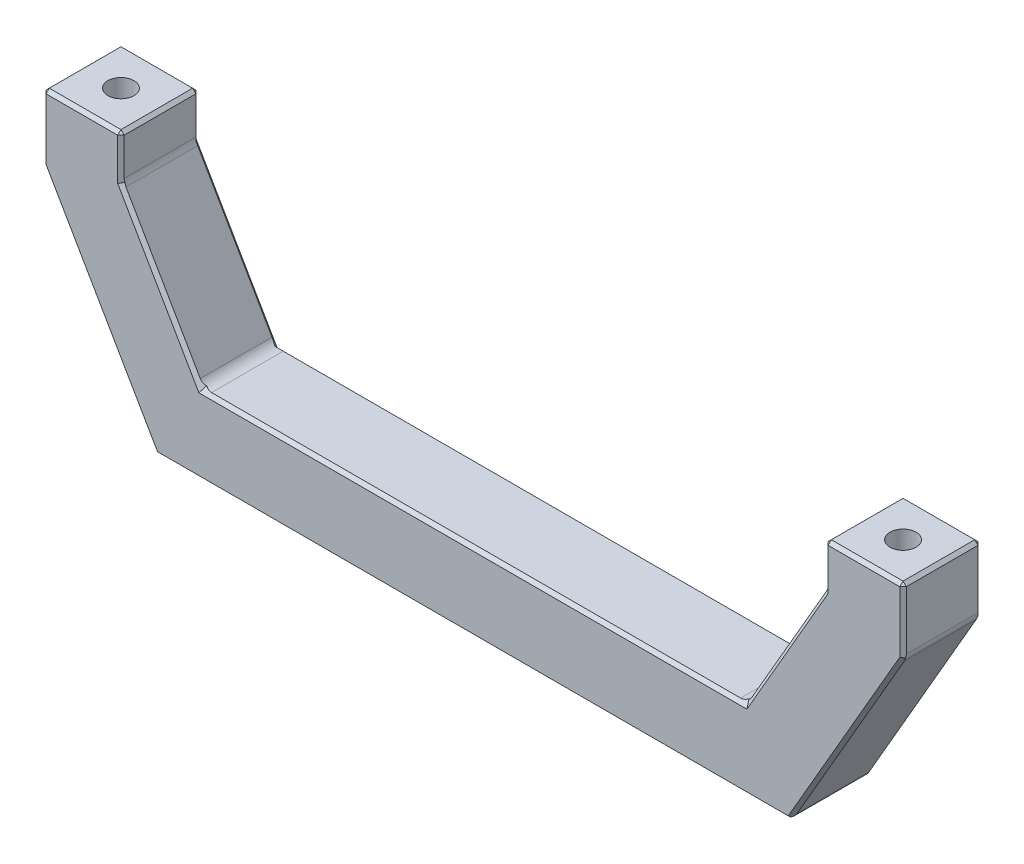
ISO-10303-21;
HEADER;
FILE_DESCRIPTION(('STEP AP214'),'2;1');
FILE_NAME('part.step','',(''),(''),'','','');
FILE_SCHEMA(('AUTOMOTIVE_DESIGN { 1 0 10303 214 1 1 1 1 }'));
ENDSEC;
DATA;
#1=APPLICATION_CONTEXT('core data for automotive mechanical design processes');
#2=APPLICATION_PROTOCOL_DEFINITION('international standard','automotive_design',2000,#1);
#3=PRODUCT_CONTEXT('',#1,'mechanical');
#4=PRODUCT('Part','Part','',(#3));
#5=PRODUCT_RELATED_PRODUCT_CATEGORY('part','',(#4));
#6=PRODUCT_DEFINITION_FORMATION('','',#4);
#7=PRODUCT_DEFINITION_CONTEXT('part definition',#1,'design');
#8=PRODUCT_DEFINITION('design','',#6,#7);
#9=PRODUCT_DEFINITION_SHAPE('','',#8);
#10=(LENGTH_UNIT() NAMED_UNIT(*) SI_UNIT(.MILLI.,.METRE.));
#11=(NAMED_UNIT(*) PLANE_ANGLE_UNIT() SI_UNIT($,.RADIAN.));
#12=(NAMED_UNIT(*) SI_UNIT($,.STERADIAN.) SOLID_ANGLE_UNIT());
#13=UNCERTAINTY_MEASURE_WITH_UNIT(LENGTH_MEASURE(1.E-05),#10,'distance_accuracy_value','');
#14=(GEOMETRIC_REPRESENTATION_CONTEXT(3) GLOBAL_UNCERTAINTY_ASSIGNED_CONTEXT((#13)) GLOBAL_UNIT_ASSIGNED_CONTEXT((#10,
#11,#12)) REPRESENTATION_CONTEXT('',''));
#15=CARTESIAN_POINT('',(0.,0.,0.));
#16=DIRECTION('',(0.,0.,1.));
#17=DIRECTION('',(1.,0.,0.));
#18=AXIS2_PLACEMENT_3D('',#15,#16,#17);
#19=CARTESIAN_POINT('',(-54.,40.,6.));
#20=DIRECTION('',(0.,-1.,0.));
#21=DIRECTION('',(1.,0.,0.));
#22=AXIS2_PLACEMENT_3D('',#19,#20,#21);
#23=PLANE('',#22);
#24=CARTESIAN_POINT('',(-60.,40.,0.));
#25=DIRECTION('',(0.,1.,0.));
#26=DIRECTION('',(-1.,0.,0.));
#27=AXIS2_PLACEMENT_3D('',#24,#25,#26);
#28=CIRCLE('',#27,2.);
#29=CARTESIAN_POINT('',(-62.,40.,0.));
#30=VERTEX_POINT('',#29);
#31=EDGE_CURVE('E1521',#30,#30,#28,.T.);
#32=ORIENTED_EDGE('',*,*,#31,.F.);
#33=EDGE_LOOP('',(#32));
#34=FACE_BOUND('',#33,.T.);
#35=DIRECTION('',(0.,0.,1.));
#36=VECTOR('',#35,1.);
#37=CARTESIAN_POINT('',(-65.5,40.,6.));
#38=LINE('',#37,#36);
#39=CARTESIAN_POINT('',(-65.5,40.,-5.50000000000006));
#40=VERTEX_POINT('',#39);
#41=CARTESIAN_POINT('',(-65.5,40.,5.50000000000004));
#42=VERTEX_POINT('',#41);
#43=EDGE_CURVE('E432',#40,#42,#38,.T.);
#44=ORIENTED_EDGE('',*,*,#43,.T.);
#45=DIRECTION('',(1.,0.,0.));
#46=VECTOR('',#45,1.);
#47=CARTESIAN_POINT('',(-54.,40.,5.50000000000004));
#48=LINE('',#47,#46);
#49=CARTESIAN_POINT('',(-54.4999999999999,40.,5.50000000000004));
#50=VERTEX_POINT('',#49);
#51=EDGE_CURVE('E434',#42,#50,#48,.T.);
#52=ORIENTED_EDGE('',*,*,#51,.T.);
#53=DIRECTION('',(0.,0.,-1.));
#54=VECTOR('',#53,1.);
#55=CARTESIAN_POINT('',(-54.4999999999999,40.,6.));
#56=LINE('',#55,#54);
#57=CARTESIAN_POINT('',(-54.4999999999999,40.,-5.50000000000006));
#58=VERTEX_POINT('',#57);
#59=EDGE_CURVE('E428',#50,#58,#56,.T.);
#60=ORIENTED_EDGE('',*,*,#59,.T.);
#61=DIRECTION('',(-1.,0.,0.));
#62=VECTOR('',#61,1.);
#63=CARTESIAN_POINT('',(-54.,40.,-5.50000000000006));
#64=LINE('',#63,#62);
#65=EDGE_CURVE('E430',#58,#40,#64,.T.);
#66=ORIENTED_EDGE('',*,*,#65,.T.);
#67=EDGE_LOOP('',(#44,#52,#60,#66));
#68=FACE_BOUND('',#67,.T.);
#69=ADVANCED_FACE('F36',(#34,#68),#23,.F.);
#70=CARTESIAN_POINT('',(-66.,40.,6.));
#71=DIRECTION('',(1.,0.,0.));
#72=DIRECTION('',(0.,1.,0.));
#73=AXIS2_PLACEMENT_3D('',#70,#71,#72);
#74=PLANE('',#73);
#75=DIRECTION('',(0.,-1.,0.));
#76=VECTOR('',#75,1.);
#77=CARTESIAN_POINT('',(-66.,40.,-5.50000000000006));
#78=LINE('',#77,#76);
#79=CARTESIAN_POINT('',(-66.,39.5000000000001,-5.50000000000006));
#80=VERTEX_POINT('',#79);
#81=CARTESIAN_POINT('',(-66.,30.5358983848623,-5.50000000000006));
#82=VERTEX_POINT('',#81);
#83=EDGE_CURVE('E423',#80,#82,#78,.T.);
#84=ORIENTED_EDGE('',*,*,#83,.T.);
#85=DIRECTION('',(0.,0.,-1.));
#86=VECTOR('',#85,1.);
#87=CARTESIAN_POINT('',(-66.,30.5358983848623,6.));
#88=LINE('',#87,#86);
#89=CARTESIAN_POINT('',(-66.,30.5358983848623,5.50000000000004));
#90=VERTEX_POINT('',#89);
#91=EDGE_CURVE('E569',#82,#90,#88,.F.);
#92=ORIENTED_EDGE('',*,*,#91,.T.);
#93=DIRECTION('',(0.,1.,0.));
#94=VECTOR('',#93,1.);
#95=CARTESIAN_POINT('',(-66.,40.,5.50000000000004));
#96=LINE('',#95,#94);
#97=CARTESIAN_POINT('',(-66.,39.5000000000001,5.50000000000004));
#98=VERTEX_POINT('',#97);
#99=EDGE_CURVE('E426',#90,#98,#96,.T.);
#100=ORIENTED_EDGE('',*,*,#99,.T.);
#101=DIRECTION('',(0.,0.,-1.));
#102=VECTOR('',#101,1.);
#103=CARTESIAN_POINT('',(-66.,39.5000000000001,6.));
#104=LINE('',#103,#102);
#105=EDGE_CURVE('E421',#98,#80,#104,.T.);
#106=ORIENTED_EDGE('',*,*,#105,.T.);
#107=EDGE_LOOP('',(#84,#92,#100,#106));
#108=FACE_BOUND('',#107,.T.);
#109=ADVANCED_FACE('F766',(#108),#74,.F.);
#110=CARTESIAN_POINT('',(-66.,30.,6.));
#111=DIRECTION('',(0.86602540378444,0.499999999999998,0.));
#112=DIRECTION('',(-0.499999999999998,0.86602540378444,0.));
#113=AXIS2_PLACEMENT_3D('',#110,#111,#112);
#114=PLANE('',#113);
#115=DIRECTION('',(-0.499999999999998,0.86602540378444,0.));
#116=VECTOR('',#115,1.);
#117=CARTESIAN_POINT('',(-66.,30.,5.50000000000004));
#118=LINE('',#117,#116);
#119=CARTESIAN_POINT('',(-49.2568421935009,1.,5.50000000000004));
#120=VERTEX_POINT('',#119);
#121=CARTESIAN_POINT('',(-65.7320508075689,29.5358983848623,5.50000000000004));
#122=VERTEX_POINT('',#121);
#123=EDGE_CURVE('E418',#120,#122,#118,.T.);
#124=ORIENTED_EDGE('',*,*,#123,.T.);
#125=DIRECTION('',(0.,0.,-1.));
#126=VECTOR('',#125,1.);
#127=CARTESIAN_POINT('',(-65.7320508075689,29.5358983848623,6.));
#128=LINE('',#127,#126);
#129=CARTESIAN_POINT('',(-65.7320508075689,29.5358983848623,-5.50000000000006));
#130=VERTEX_POINT('',#129);
#131=EDGE_CURVE('E560',#122,#130,#128,.T.);
#132=ORIENTED_EDGE('',*,*,#131,.T.);
#133=DIRECTION('',(0.499999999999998,-0.86602540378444,0.));
#134=VECTOR('',#133,1.);
#135=CARTESIAN_POINT('',(-66.,30.,-5.50000000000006));
#136=LINE('',#135,#134);
#137=CARTESIAN_POINT('',(-49.2568421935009,1.,-5.50000000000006));
#138=VERTEX_POINT('',#137);
#139=EDGE_CURVE('E415',#130,#138,#136,.T.);
#140=ORIENTED_EDGE('',*,*,#139,.T.);
#141=DIRECTION('',(0.,0.,-1.));
#142=VECTOR('',#141,1.);
#143=CARTESIAN_POINT('',(-49.2568421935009,1.,6.));
#144=LINE('',#143,#142);
#145=EDGE_CURVE('E461',#138,#120,#144,.F.);
#146=ORIENTED_EDGE('',*,*,#145,.T.);
#147=EDGE_LOOP('',(#124,#132,#140,#146));
#148=FACE_BOUND('',#147,.T.);
#149=ADVANCED_FACE('F768',(#148),#114,.F.);
#150=CARTESIAN_POINT('',(-48.6794919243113,0.,6.));
#151=DIRECTION('',(0.,1.,0.));
#152=DIRECTION('',(-1.,0.,0.));
#153=AXIS2_PLACEMENT_3D('',#150,#151,#152);
#154=PLANE('',#153);
#155=DIRECTION('',(-1.,0.,0.));
#156=VECTOR('',#155,1.);
#157=CARTESIAN_POINT('',(-48.6794919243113,0.,5.50000000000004));
#158=LINE('',#157,#156);
#159=CARTESIAN_POINT('',(47.5247913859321,0.,5.50000000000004));
#160=VERTEX_POINT('',#159);
#161=CARTESIAN_POINT('',(-47.5247913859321,0.,5.50000000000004));
#162=VERTEX_POINT('',#161);
#163=EDGE_CURVE('E412',#160,#162,#158,.T.);
#164=ORIENTED_EDGE('',*,*,#163,.T.);
#165=DIRECTION('',(0.,0.,-1.));
#166=VECTOR('',#165,1.);
#167=CARTESIAN_POINT('',(-47.5247913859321,0.,6.));
#168=LINE('',#167,#166);
#169=CARTESIAN_POINT('',(-47.5247913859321,0.,-5.50000000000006));
#170=VERTEX_POINT('',#169);
#171=EDGE_CURVE('E579',#162,#170,#168,.T.);
#172=ORIENTED_EDGE('',*,*,#171,.T.);
#173=DIRECTION('',(1.,0.,0.));
#174=VECTOR('',#173,1.);
#175=CARTESIAN_POINT('',(-48.6794919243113,0.,-5.50000000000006));
#176=LINE('',#175,#174);
#177=CARTESIAN_POINT('',(47.5247913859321,0.,-5.50000000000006));
#178=VERTEX_POINT('',#177);
#179=EDGE_CURVE('E409',#170,#178,#176,.T.);
#180=ORIENTED_EDGE('',*,*,#179,.T.);
#181=DIRECTION('',(0.,0.,-1.));
#182=VECTOR('',#181,1.);
#183=CARTESIAN_POINT('',(47.5247913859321,0.,6.));
#184=LINE('',#183,#182);
#185=EDGE_CURVE('E577',#178,#160,#184,.F.);
#186=ORIENTED_EDGE('',*,*,#185,.T.);
#187=EDGE_LOOP('',(#164,#172,#180,#186));
#188=FACE_BOUND('',#187,.T.);
#189=ADVANCED_FACE('F774',(#188),#154,.F.);
#190=CARTESIAN_POINT('',(48.6794919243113,0.,6.));
#191=DIRECTION('',(-0.86602540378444,0.499999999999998,0.));
#192=DIRECTION('',(-0.499999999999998,-0.86602540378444,0.));
#193=AXIS2_PLACEMENT_3D('',#190,#191,#192);
#194=PLANE('',#193);
#195=DIRECTION('',(-0.499999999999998,-0.86602540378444,0.));
#196=VECTOR('',#195,1.);
#197=CARTESIAN_POINT('',(48.6794919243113,0.,5.50000000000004));
#198=LINE('',#197,#196);
#199=CARTESIAN_POINT('',(65.7320508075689,29.5358983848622,5.50000000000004));
#200=VERTEX_POINT('',#199);
#201=CARTESIAN_POINT('',(49.256842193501,1.00000000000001,5.50000000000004));
#202=VERTEX_POINT('',#201);
#203=EDGE_CURVE('E406',#200,#202,#198,.T.);
#204=ORIENTED_EDGE('',*,*,#203,.T.);
#205=DIRECTION('',(0.,0.,-1.));
#206=VECTOR('',#205,1.);
#207=CARTESIAN_POINT('',(49.256842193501,1.00000000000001,6.));
#208=LINE('',#207,#206);
#209=CARTESIAN_POINT('',(49.256842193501,1.00000000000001,-5.50000000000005));
#210=VERTEX_POINT('',#209);
#211=EDGE_CURVE('E592',#202,#210,#208,.T.);
#212=ORIENTED_EDGE('',*,*,#211,.T.);
#213=DIRECTION('',(0.499999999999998,0.86602540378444,0.));
#214=VECTOR('',#213,1.);
#215=CARTESIAN_POINT('',(48.6794919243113,0.,-5.50000000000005));
#216=LINE('',#215,#214);
#217=CARTESIAN_POINT('',(65.7320508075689,29.5358983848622,-5.50000000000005));
#218=VERTEX_POINT('',#217);
#219=EDGE_CURVE('E403',#210,#218,#216,.T.);
#220=ORIENTED_EDGE('',*,*,#219,.T.);
#221=DIRECTION('',(0.,0.,-1.));
#222=VECTOR('',#221,1.);
#223=CARTESIAN_POINT('',(65.7320508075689,29.5358983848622,6.));
#224=LINE('',#223,#222);
#225=EDGE_CURVE('E590',#218,#200,#224,.F.);
#226=ORIENTED_EDGE('',*,*,#225,.T.);
#227=EDGE_LOOP('',(#204,#212,#220,#226));
#228=FACE_BOUND('',#227,.T.);
#229=ADVANCED_FACE('F1070',(#228),#194,.F.);
#230=CARTESIAN_POINT('',(66.,30.,6.));
#231=DIRECTION('',(-1.,0.,0.));
#232=DIRECTION('',(0.,-1.,0.));
#233=AXIS2_PLACEMENT_3D('',#230,#231,#232);
#234=PLANE('',#233);
#235=DIRECTION('',(0.,-1.,0.));
#236=VECTOR('',#235,1.);
#237=CARTESIAN_POINT('',(66.,30.,5.50000000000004));
#238=LINE('',#237,#236);
#239=CARTESIAN_POINT('',(66.,39.4999999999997,5.50000000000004));
#240=VERTEX_POINT('',#239);
#241=CARTESIAN_POINT('',(66.,30.5358983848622,5.50000000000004));
#242=VERTEX_POINT('',#241);
#243=EDGE_CURVE('E400',#240,#242,#238,.T.);
#244=ORIENTED_EDGE('',*,*,#243,.T.);
#245=DIRECTION('',(0.,0.,-1.));
#246=VECTOR('',#245,1.);
#247=CARTESIAN_POINT('',(66.,30.5358983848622,6.));
#248=LINE('',#247,#246);
#249=CARTESIAN_POINT('',(66.,30.5358983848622,-5.50000000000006));
#250=VERTEX_POINT('',#249);
#251=EDGE_CURVE('E603',#242,#250,#248,.T.);
#252=ORIENTED_EDGE('',*,*,#251,.T.);
#253=DIRECTION('',(0.,1.,0.));
#254=VECTOR('',#253,1.);
#255=CARTESIAN_POINT('',(66.,30.,-5.50000000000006));
#256=LINE('',#255,#254);
#257=CARTESIAN_POINT('',(66.,39.4999999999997,-5.50000000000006));
#258=VERTEX_POINT('',#257);
#259=EDGE_CURVE('E398',#250,#258,#256,.T.);
#260=ORIENTED_EDGE('',*,*,#259,.T.);
#261=DIRECTION('',(0.,0.,1.));
#262=VECTOR('',#261,1.);
#263=CARTESIAN_POINT('',(66.,39.4999999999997,6.));
#264=LINE('',#263,#262);
#265=EDGE_CURVE('E396',#258,#240,#264,.T.);
#266=ORIENTED_EDGE('',*,*,#265,.T.);
#267=EDGE_LOOP('',(#244,#252,#260,#266));
#268=FACE_BOUND('',#267,.T.);
#269=ADVANCED_FACE('F1066',(#268),#234,.F.);
#270=CARTESIAN_POINT('',(66.,39.9999999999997,6.));
#271=DIRECTION('',(0.,-1.,0.));
#272=DIRECTION('',(1.,0.,0.));
#273=AXIS2_PLACEMENT_3D('',#270,#271,#272);
#274=PLANE('',#273);
#275=CARTESIAN_POINT('',(60.,40.0000000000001,0.));
#276=DIRECTION('',(0.,1.,0.));
#277=DIRECTION('',(-1.,0.,0.));
#278=AXIS2_PLACEMENT_3D('',#275,#276,#277);
#279=CIRCLE('',#278,2.);
#280=CARTESIAN_POINT('',(58.,40.0000000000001,0.));
#281=VERTEX_POINT('',#280);
#282=EDGE_CURVE('E1528',#281,#281,#279,.T.);
#283=ORIENTED_EDGE('',*,*,#282,.F.);
#284=EDGE_LOOP('',(#283));
#285=FACE_BOUND('',#284,.T.);
#286=DIRECTION('',(0.,0.,1.));
#287=VECTOR('',#286,1.);
#288=CARTESIAN_POINT('',(54.5,40.,6.));
#289=LINE('',#288,#287);
#290=CARTESIAN_POINT('',(54.5,40.,-5.50000000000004));
#291=VERTEX_POINT('',#290);
#292=CARTESIAN_POINT('',(54.5,40.,5.50000000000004));
#293=VERTEX_POINT('',#292);
#294=EDGE_CURVE('E387',#291,#293,#289,.T.);
#295=ORIENTED_EDGE('',*,*,#294,.T.);
#296=DIRECTION('',(1.,0.,0.));
#297=VECTOR('',#296,1.);
#298=CARTESIAN_POINT('',(66.,39.9999999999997,5.50000000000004));
#299=LINE('',#298,#297);
#300=CARTESIAN_POINT('',(65.5000000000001,39.9999999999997,5.50000000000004));
#301=VERTEX_POINT('',#300);
#302=EDGE_CURVE('E393',#293,#301,#299,.T.);
#303=ORIENTED_EDGE('',*,*,#302,.T.);
#304=DIRECTION('',(0.,0.,-1.));
#305=VECTOR('',#304,1.);
#306=CARTESIAN_POINT('',(65.5000000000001,39.9999999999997,6.));
#307=LINE('',#306,#305);
#308=CARTESIAN_POINT('',(65.5000000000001,39.9999999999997,-5.50000000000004));
#309=VERTEX_POINT('',#308);
#310=EDGE_CURVE('E391',#301,#309,#307,.T.);
#311=ORIENTED_EDGE('',*,*,#310,.T.);
#312=DIRECTION('',(-1.,0.,0.));
#313=VECTOR('',#312,1.);
#314=CARTESIAN_POINT('',(66.,39.9999999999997,-5.50000000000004));
#315=LINE('',#314,#313);
#316=EDGE_CURVE('E389',#309,#291,#315,.T.);
#317=ORIENTED_EDGE('',*,*,#316,.T.);
#318=EDGE_LOOP('',(#295,#303,#311,#317));
#319=FACE_BOUND('',#318,.T.);
#320=ADVANCED_FACE('F1062',(#285,#319),#274,.F.);
#321=CARTESIAN_POINT('',(54.,40.,6.));
#322=DIRECTION('',(1.,0.,0.));
#323=DIRECTION('',(0.,1.,0.));
#324=AXIS2_PLACEMENT_3D('',#321,#322,#323);
#325=PLANE('',#324);
#326=DIRECTION('',(0.,-1.,0.));
#327=VECTOR('',#326,1.);
#328=CARTESIAN_POINT('',(54.,40.,-5.50000000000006));
#329=LINE('',#328,#327);
#330=CARTESIAN_POINT('',(54.,39.5,-5.50000000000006));
#331=VERTEX_POINT('',#330);
#332=CARTESIAN_POINT('',(54.,33.7512886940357,-5.50000000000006));
#333=VERTEX_POINT('',#332);
#334=EDGE_CURVE('E382',#331,#333,#329,.T.);
#335=ORIENTED_EDGE('',*,*,#334,.T.);
#336=DIRECTION('',(0.,0.,-1.));
#337=VECTOR('',#336,1.);
#338=CARTESIAN_POINT('',(54.,33.7512886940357,5.50000000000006));
#339=LINE('',#338,#337);
#340=CARTESIAN_POINT('',(54.,33.7512886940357,5.50000000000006));
#341=VERTEX_POINT('',#340);
#342=EDGE_CURVE('E615',#333,#341,#339,.F.);
#343=ORIENTED_EDGE('',*,*,#342,.T.);
#344=DIRECTION('',(0.,1.,0.));
#345=VECTOR('',#344,1.);
#346=CARTESIAN_POINT('',(54.,40.,5.50000000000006));
#347=LINE('',#346,#345);
#348=CARTESIAN_POINT('',(54.,39.5,5.50000000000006));
#349=VERTEX_POINT('',#348);
#350=EDGE_CURVE('E385',#341,#349,#347,.T.);
#351=ORIENTED_EDGE('',*,*,#350,.T.);
#352=DIRECTION('',(0.,0.,-1.));
#353=VECTOR('',#352,1.);
#354=CARTESIAN_POINT('',(54.,39.5,6.));
#355=LINE('',#354,#353);
#356=EDGE_CURVE('E380',#349,#331,#355,.T.);
#357=ORIENTED_EDGE('',*,*,#356,.T.);
#358=EDGE_LOOP('',(#335,#343,#351,#357));
#359=FACE_BOUND('',#358,.T.);
#360=ADVANCED_FACE('F1058',(#359),#325,.F.);
#361=CARTESIAN_POINT('',(54.,33.2153903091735,6.));
#362=DIRECTION('',(0.86602540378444,-0.499999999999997,0.));
#363=DIRECTION('',(0.499999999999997,0.86602540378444,0.));
#364=AXIS2_PLACEMENT_3D('',#361,#362,#363);
#365=PLANE('',#364);
#366=DIRECTION('',(0.499999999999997,0.86602540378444,0.));
#367=VECTOR('',#366,1.);
#368=CARTESIAN_POINT('',(54.,33.2153903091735,5.50000000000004));
#369=LINE('',#368,#367);
#370=CARTESIAN_POINT('',(42.3286389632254,13.,5.50000000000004));
#371=VERTEX_POINT('',#370);
#372=CARTESIAN_POINT('',(53.7320508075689,32.7512886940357,5.50000000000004));
#373=VERTEX_POINT('',#372);
#374=EDGE_CURVE('E377',#371,#373,#369,.T.);
#375=ORIENTED_EDGE('',*,*,#374,.T.);
#376=DIRECTION('',(0.,0.,-1.));
#377=VECTOR('',#376,1.);
#378=CARTESIAN_POINT('',(53.7320508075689,32.7512886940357,-5.50000000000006));
#379=LINE('',#378,#377);
#380=CARTESIAN_POINT('',(53.7320508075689,32.7512886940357,-5.50000000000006));
#381=VERTEX_POINT('',#380);
#382=EDGE_CURVE('E612',#373,#381,#379,.T.);
#383=ORIENTED_EDGE('',*,*,#382,.T.);
#384=DIRECTION('',(-0.499999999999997,-0.86602540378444,0.));
#385=VECTOR('',#384,1.);
#386=CARTESIAN_POINT('',(54.,33.2153903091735,-5.50000000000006));
#387=LINE('',#386,#385);
#388=CARTESIAN_POINT('',(42.3286389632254,13.,-5.50000000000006));
#389=VERTEX_POINT('',#388);
#390=EDGE_CURVE('E374',#381,#389,#387,.T.);
#391=ORIENTED_EDGE('',*,*,#390,.T.);
#392=DIRECTION('',(0.,0.,-1.));
#393=VECTOR('',#392,1.);
#394=CARTESIAN_POINT('',(42.3286389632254,13.,5.50000000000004));
#395=LINE('',#394,#393);
#396=EDGE_CURVE('E610',#389,#371,#395,.F.);
#397=ORIENTED_EDGE('',*,*,#396,.T.);
#398=EDGE_LOOP('',(#375,#383,#391,#397));
#399=FACE_BOUND('',#398,.T.);
#400=ADVANCED_FACE('F1054',(#399),#365,.F.);
#401=CARTESIAN_POINT('',(41.7512886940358,12.,6.));
#402=DIRECTION('',(0.,-1.,0.));
#403=DIRECTION('',(1.,0.,0.));
#404=AXIS2_PLACEMENT_3D('',#401,#402,#403);
#405=PLANE('',#404);
#406=DIRECTION('',(1.,0.,0.));
#407=VECTOR('',#406,1.);
#408=CARTESIAN_POINT('',(41.7512886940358,12.,5.50000000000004));
#409=LINE('',#408,#407);
#410=CARTESIAN_POINT('',(-40.5965881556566,12.,5.50000000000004));
#411=VERTEX_POINT('',#410);
#412=CARTESIAN_POINT('',(40.5965881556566,12.,5.50000000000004));
#413=VERTEX_POINT('',#412);
#414=EDGE_CURVE('E371',#411,#413,#409,.T.);
#415=ORIENTED_EDGE('',*,*,#414,.T.);
#416=DIRECTION('',(0.,0.,-1.));
#417=VECTOR('',#416,1.);
#418=CARTESIAN_POINT('',(40.5965881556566,12.,-5.50000000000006));
#419=LINE('',#418,#417);
#420=CARTESIAN_POINT('',(40.5965881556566,12.,-5.50000000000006));
#421=VERTEX_POINT('',#420);
#422=EDGE_CURVE('E619',#413,#421,#419,.T.);
#423=ORIENTED_EDGE('',*,*,#422,.T.);
#424=DIRECTION('',(-1.,0.,0.));
#425=VECTOR('',#424,1.);
#426=CARTESIAN_POINT('',(41.7512886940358,12.,-5.50000000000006));
#427=LINE('',#426,#425);
#428=CARTESIAN_POINT('',(-40.5965881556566,12.,-5.50000000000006));
#429=VERTEX_POINT('',#428);
#430=EDGE_CURVE('E368',#421,#429,#427,.T.);
#431=ORIENTED_EDGE('',*,*,#430,.T.);
#432=DIRECTION('',(0.,0.,-1.));
#433=VECTOR('',#432,1.);
#434=CARTESIAN_POINT('',(-40.5965881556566,12.,5.50000000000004));
#435=LINE('',#434,#433);
#436=EDGE_CURVE('E617',#429,#411,#435,.F.);
#437=ORIENTED_EDGE('',*,*,#436,.T.);
#438=EDGE_LOOP('',(#415,#423,#431,#437));
#439=FACE_BOUND('',#438,.T.);
#440=ADVANCED_FACE('F1051',(#439),#405,.F.);
#441=CARTESIAN_POINT('',(-41.7512886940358,12.,6.));
#442=DIRECTION('',(-0.86602540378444,-0.499999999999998,0.));
#443=DIRECTION('',(0.499999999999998,-0.86602540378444,0.));
#444=AXIS2_PLACEMENT_3D('',#441,#442,#443);
#445=PLANE('',#444);
#446=DIRECTION('',(0.499999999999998,-0.86602540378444,0.));
#447=VECTOR('',#446,1.);
#448=CARTESIAN_POINT('',(-41.7512886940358,12.,5.50000000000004));
#449=LINE('',#448,#447);
#450=CARTESIAN_POINT('',(-53.7320508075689,32.7512886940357,5.50000000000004));
#451=VERTEX_POINT('',#450);
#452=CARTESIAN_POINT('',(-42.3286389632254,13.,5.50000000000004));
#453=VERTEX_POINT('',#452);
#454=EDGE_CURVE('E365',#451,#453,#449,.T.);
#455=ORIENTED_EDGE('',*,*,#454,.T.);
#456=DIRECTION('',(0.,0.,-1.));
#457=VECTOR('',#456,1.);
#458=CARTESIAN_POINT('',(-42.3286389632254,13.,-5.50000000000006));
#459=LINE('',#458,#457);
#460=CARTESIAN_POINT('',(-42.3286389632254,13.,-5.50000000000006));
#461=VERTEX_POINT('',#460);
#462=EDGE_CURVE('E624',#453,#461,#459,.T.);
#463=ORIENTED_EDGE('',*,*,#462,.T.);
#464=DIRECTION('',(-0.499999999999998,0.86602540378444,0.));
#465=VECTOR('',#464,1.);
#466=CARTESIAN_POINT('',(-41.7512886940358,12.,-5.50000000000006));
#467=LINE('',#466,#465);
#468=CARTESIAN_POINT('',(-53.7320508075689,32.7512886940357,-5.50000000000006));
#469=VERTEX_POINT('',#468);
#470=EDGE_CURVE('E362',#461,#469,#467,.T.);
#471=ORIENTED_EDGE('',*,*,#470,.T.);
#472=DIRECTION('',(0.,0.,-1.));
#473=VECTOR('',#472,1.);
#474=CARTESIAN_POINT('',(-53.7320508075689,32.7512886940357,5.50000000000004));
#475=LINE('',#474,#473);
#476=EDGE_CURVE('E622',#469,#451,#475,.F.);
#477=ORIENTED_EDGE('',*,*,#476,.T.);
#478=EDGE_LOOP('',(#455,#463,#471,#477));
#479=FACE_BOUND('',#478,.T.);
#480=ADVANCED_FACE('F726',(#479),#445,.F.);
#481=CARTESIAN_POINT('',(-54.,33.2153903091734,6.));
#482=DIRECTION('',(-1.,0.,0.));
#483=DIRECTION('',(0.,0.,1.));
#484=AXIS2_PLACEMENT_3D('',#481,#482,#483);
#485=PLANE('',#484);
#486=DIRECTION('',(0.,-1.,0.));
#487=VECTOR('',#486,1.);
#488=CARTESIAN_POINT('',(-54.,33.2153903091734,5.50000000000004));
#489=LINE('',#488,#487);
#490=CARTESIAN_POINT('',(-54.,39.5000000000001,5.50000000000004));
#491=VERTEX_POINT('',#490);
#492=CARTESIAN_POINT('',(-54.,33.7512886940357,5.50000000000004));
#493=VERTEX_POINT('',#492);
#494=EDGE_CURVE('E323',#491,#493,#489,.T.);
#495=ORIENTED_EDGE('',*,*,#494,.T.);
#496=DIRECTION('',(0.,0.,-1.));
#497=VECTOR('',#496,1.);
#498=CARTESIAN_POINT('',(-54.,33.7512886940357,-5.50000000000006));
#499=LINE('',#498,#497);
#500=CARTESIAN_POINT('',(-54.,33.7512886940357,-5.50000000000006));
#501=VERTEX_POINT('',#500);
#502=EDGE_CURVE('E627',#493,#501,#499,.T.);
#503=ORIENTED_EDGE('',*,*,#502,.T.);
#504=DIRECTION('',(0.,1.,0.));
#505=VECTOR('',#504,1.);
#506=CARTESIAN_POINT('',(-54.,33.2153903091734,-5.50000000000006));
#507=LINE('',#506,#505);
#508=CARTESIAN_POINT('',(-54.,39.5000000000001,-5.50000000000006));
#509=VERTEX_POINT('',#508);
#510=EDGE_CURVE('E352',#501,#509,#507,.T.);
#511=ORIENTED_EDGE('',*,*,#510,.T.);
#512=DIRECTION('',(0.,0.,1.));
#513=VECTOR('',#512,1.);
#514=CARTESIAN_POINT('',(-54.,39.5000000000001,6.));
#515=LINE('',#514,#513);
#516=EDGE_CURVE('E354',#509,#491,#515,.T.);
#517=ORIENTED_EDGE('',*,*,#516,.T.);
#518=EDGE_LOOP('',(#495,#503,#511,#517));
#519=FACE_BOUND('',#518,.T.);
#520=ADVANCED_FACE('F672',(#519),#485,.F.);
#521=CARTESIAN_POINT('',(0.,0.,6.));
#522=DIRECTION('',(0.,0.,1.));
#523=DIRECTION('',(1.,0.,0.));
#524=AXIS2_PLACEMENT_3D('',#521,#522,#523);
#525=PLANE('',#524);
#526=DIRECTION('',(-0.499999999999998,0.86602540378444,0.));
#527=VECTOR('',#526,1.);
#528=CARTESIAN_POINT('',(-54.4330127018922,32.9653903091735,6.));
#529=LINE('',#528,#527);
#530=CARTESIAN_POINT('',(-42.0399638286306,11.5,6.));
#531=VERTEX_POINT('',#530);
#532=CARTESIAN_POINT('',(-54.4999999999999,33.0814157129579,6.));
#533=VERTEX_POINT('',#532);
#534=EDGE_CURVE('E351',#531,#533,#529,.T.);
#535=ORIENTED_EDGE('',*,*,#534,.T.);
#536=DIRECTION('',(0.,1.,0.));
#537=VECTOR('',#536,1.);
#538=CARTESIAN_POINT('',(-54.4999999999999,40.,6.));
#539=LINE('',#538,#537);
#540=CARTESIAN_POINT('',(-54.4999999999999,39.5000000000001,6.));
#541=VERTEX_POINT('',#540);
#542=EDGE_CURVE('E321',#533,#541,#539,.T.);
#543=ORIENTED_EDGE('',*,*,#542,.T.);
#544=DIRECTION('',(-1.,0.,0.));
#545=VECTOR('',#544,1.);
#546=CARTESIAN_POINT('',(-66.,39.5000000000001,6.));
#547=LINE('',#546,#545);
#548=CARTESIAN_POINT('',(-65.5,39.5000000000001,6.));
#549=VERTEX_POINT('',#548);
#550=EDGE_CURVE('E339',#541,#549,#547,.T.);
#551=ORIENTED_EDGE('',*,*,#550,.T.);
#552=DIRECTION('',(0.,-1.,0.));
#553=VECTOR('',#552,1.);
#554=CARTESIAN_POINT('',(-65.5000000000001,30.,6.));
#555=LINE('',#554,#553);
#556=CARTESIAN_POINT('',(-65.5000000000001,30.1339745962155,6.));
#557=VERTEX_POINT('',#556);
#558=EDGE_CURVE('E346',#549,#557,#555,.T.);
#559=ORIENTED_EDGE('',*,*,#558,.T.);
#560=DIRECTION('',(0.499999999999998,-0.86602540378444,0.));
#561=VECTOR('',#560,1.);
#562=CARTESIAN_POINT('',(-48.2464792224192,0.249999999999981,6.));
#563=LINE('',#562,#561);
#564=CARTESIAN_POINT('',(-48.3908167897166,0.499999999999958,6.));
#565=VERTEX_POINT('',#564);
#566=EDGE_CURVE('E696',#557,#565,#563,.T.);
#567=ORIENTED_EDGE('',*,*,#566,.T.);
#568=DIRECTION('',(1.,0.,0.));
#569=VECTOR('',#568,1.);
#570=CARTESIAN_POINT('',(48.6794919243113,0.499999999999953,6.));
#571=LINE('',#570,#569);
#572=CARTESIAN_POINT('',(48.3908167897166,0.499999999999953,6.));
#573=VERTEX_POINT('',#572);
#574=EDGE_CURVE('E698',#565,#573,#571,.T.);
#575=ORIENTED_EDGE('',*,*,#574,.T.);
#576=DIRECTION('',(0.499999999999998,0.86602540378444,0.));
#577=VECTOR('',#576,1.);
#578=CARTESIAN_POINT('',(65.5669872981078,30.25,6.));
#579=LINE('',#578,#577);
#580=CARTESIAN_POINT('',(65.5000000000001,30.1339745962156,6.));
#581=VERTEX_POINT('',#580);
#582=EDGE_CURVE('E704',#573,#581,#579,.T.);
#583=ORIENTED_EDGE('',*,*,#582,.T.);
#584=DIRECTION('',(0.,1.,0.));
#585=VECTOR('',#584,1.);
#586=CARTESIAN_POINT('',(65.5000000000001,39.9999999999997,6.));
#587=LINE('',#586,#585);
#588=CARTESIAN_POINT('',(65.5000000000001,39.4999999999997,6.));
#589=VERTEX_POINT('',#588);
#590=EDGE_CURVE('E707',#581,#589,#587,.T.);
#591=ORIENTED_EDGE('',*,*,#590,.T.);
#592=DIRECTION('',(-1.,0.,0.));
#593=VECTOR('',#592,1.);
#594=CARTESIAN_POINT('',(54.,39.5000000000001,6.));
#595=LINE('',#594,#593);
#596=CARTESIAN_POINT('',(54.5,39.5,6.));
#597=VERTEX_POINT('',#596);
#598=EDGE_CURVE('E709',#589,#597,#595,.T.);
#599=ORIENTED_EDGE('',*,*,#598,.T.);
#600=DIRECTION('',(0.,-1.,0.));
#601=VECTOR('',#600,1.);
#602=CARTESIAN_POINT('',(54.5,33.2153903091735,6.));
#603=LINE('',#602,#601);
#604=CARTESIAN_POINT('',(54.5,33.081415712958,6.));
#605=VERTEX_POINT('',#604);
#606=EDGE_CURVE('E711',#597,#605,#603,.T.);
#607=ORIENTED_EDGE('',*,*,#606,.T.);
#608=DIRECTION('',(-0.499999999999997,-0.86602540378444,0.));
#609=VECTOR('',#608,1.);
#610=CARTESIAN_POINT('',(42.184301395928,11.75,6.));
#611=LINE('',#610,#609);
#612=CARTESIAN_POINT('',(42.0399638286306,11.5000000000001,6.));
#613=VERTEX_POINT('',#612);
#614=EDGE_CURVE('E713',#605,#613,#611,.T.);
#615=ORIENTED_EDGE('',*,*,#614,.T.);
#616=DIRECTION('',(-1.,0.,0.));
#617=VECTOR('',#616,1.);
#618=CARTESIAN_POINT('',(-41.7512886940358,11.5,6.));
#619=LINE('',#618,#617);
#620=EDGE_CURVE('E356',#613,#531,#619,.T.);
#621=ORIENTED_EDGE('',*,*,#620,.T.);
#622=EDGE_LOOP('',(#535,#543,#551,#559,#567,#575,#583,#591,#599,#607,#615,#621));
#623=FACE_BOUND('',#622,.T.);
#624=ADVANCED_FACE('F349',(#623),#525,.T.);
#625=CARTESIAN_POINT('',(0.,0.,-6.));
#626=DIRECTION('',(0.,0.,1.));
#627=DIRECTION('',(1.,0.,0.));
#628=AXIS2_PLACEMENT_3D('',#625,#626,#627);
#629=PLANE('',#628);
#630=DIRECTION('',(-0.499999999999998,0.86602540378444,0.));
#631=VECTOR('',#630,1.);
#632=CARTESIAN_POINT('',(-36.0766062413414,-20.8288383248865,-6.));
#633=LINE('',#632,#631);
#634=CARTESIAN_POINT('',(-48.3908167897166,0.499999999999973,-6.));
#635=VERTEX_POINT('',#634);
#636=CARTESIAN_POINT('',(-65.5,30.1339745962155,-6.));
#637=VERTEX_POINT('',#636);
#638=EDGE_CURVE('E457',#635,#637,#633,.T.);
#639=ORIENTED_EDGE('',*,*,#638,.T.);
#640=DIRECTION('',(0.,1.,0.));
#641=VECTOR('',#640,1.);
#642=CARTESIAN_POINT('',(-65.5000000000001,1.8179902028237E-13,-6.));
#643=LINE('',#642,#641);
#644=CARTESIAN_POINT('',(-65.5,39.5,-6.));
#645=VERTEX_POINT('',#644);
#646=EDGE_CURVE('E459',#637,#645,#643,.T.);
#647=ORIENTED_EDGE('',*,*,#646,.T.);
#648=DIRECTION('',(1.,0.,0.));
#649=VECTOR('',#648,1.);
#650=CARTESIAN_POINT('',(0.,39.5000000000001,-6.));
#651=LINE('',#650,#649);
#652=CARTESIAN_POINT('',(-54.5,39.5000000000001,-6.));
#653=VERTEX_POINT('',#652);
#654=EDGE_CURVE('E447',#645,#653,#651,.T.);
#655=ORIENTED_EDGE('',*,*,#654,.T.);
#656=DIRECTION('',(0.,-1.,0.));
#657=VECTOR('',#656,1.);
#658=CARTESIAN_POINT('',(-54.5,0.,-6.));
#659=LINE('',#658,#657);
#660=CARTESIAN_POINT('',(-54.5,33.0814157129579,-6.));
#661=VERTEX_POINT('',#660);
#662=EDGE_CURVE('E445',#653,#661,#659,.T.);
#663=ORIENTED_EDGE('',*,*,#662,.T.);
#664=DIRECTION('',(0.499999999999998,-0.86602540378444,0.));
#665=VECTOR('',#664,1.);
#666=CARTESIAN_POINT('',(-26.5503267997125,-15.3288383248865,-6.));
#667=LINE('',#666,#665);
#668=CARTESIAN_POINT('',(-42.0399638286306,11.5,-6.));
#669=VERTEX_POINT('',#668);
#670=EDGE_CURVE('E443',#661,#669,#667,.T.);
#671=ORIENTED_EDGE('',*,*,#670,.T.);
#672=DIRECTION('',(1.,0.,0.));
#673=VECTOR('',#672,1.);
#674=CARTESIAN_POINT('',(0.,11.5,-6.));
#675=LINE('',#674,#673);
#676=CARTESIAN_POINT('',(42.0399638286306,11.5,-6.));
#677=VERTEX_POINT('',#676);
#678=EDGE_CURVE('E441',#669,#677,#675,.T.);
#679=ORIENTED_EDGE('',*,*,#678,.T.);
#680=DIRECTION('',(0.499999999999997,0.86602540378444,0.));
#681=VECTOR('',#680,1.);
#682=CARTESIAN_POINT('',(26.5503267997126,-15.3288383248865,-6.));
#683=LINE('',#682,#681);
#684=CARTESIAN_POINT('',(54.5,33.0814157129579,-6.));
#685=VERTEX_POINT('',#684);
#686=EDGE_CURVE('E439',#677,#685,#683,.T.);
#687=ORIENTED_EDGE('',*,*,#686,.T.);
#688=DIRECTION('',(0.,1.,0.));
#689=VECTOR('',#688,1.);
#690=CARTESIAN_POINT('',(54.5,0.,-6.));
#691=LINE('',#690,#689);
#692=CARTESIAN_POINT('',(54.5,39.5,-6.));
#693=VERTEX_POINT('',#692);
#694=EDGE_CURVE('E437',#685,#693,#691,.T.);
#695=ORIENTED_EDGE('',*,*,#694,.T.);
#696=DIRECTION('',(1.,0.,0.));
#697=VECTOR('',#696,1.);
#698=CARTESIAN_POINT('',(1.09634523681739E-12,39.5000000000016,-6.));
#699=LINE('',#698,#697);
#700=CARTESIAN_POINT('',(65.5,39.4999999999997,-6.));
#701=VERTEX_POINT('',#700);
#702=EDGE_CURVE('E449',#693,#701,#699,.T.);
#703=ORIENTED_EDGE('',*,*,#702,.T.);
#704=DIRECTION('',(0.,-1.,0.));
#705=VECTOR('',#704,1.);
#706=CARTESIAN_POINT('',(65.5,0.,-6.));
#707=LINE('',#706,#705);
#708=CARTESIAN_POINT('',(65.5,30.1339745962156,-6.));
#709=VERTEX_POINT('',#708);
#710=EDGE_CURVE('E451',#701,#709,#707,.T.);
#711=ORIENTED_EDGE('',*,*,#710,.T.);
#712=DIRECTION('',(-0.499999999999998,-0.86602540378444,0.));
#713=VECTOR('',#712,1.);
#714=CARTESIAN_POINT('',(36.0766062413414,-20.8288383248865,-6.));
#715=LINE('',#714,#713);
#716=CARTESIAN_POINT('',(48.3908167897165,0.499999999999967,-6.));
#717=VERTEX_POINT('',#716);
#718=EDGE_CURVE('E453',#709,#717,#715,.T.);
#719=ORIENTED_EDGE('',*,*,#718,.T.);
#720=DIRECTION('',(-1.,0.,0.));
#721=VECTOR('',#720,1.);
#722=CARTESIAN_POINT('',(0.,0.49999999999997,-6.));
#723=LINE('',#722,#721);
#724=EDGE_CURVE('E455',#717,#635,#723,.T.);
#725=ORIENTED_EDGE('',*,*,#724,.T.);
#726=EDGE_LOOP('',(#639,#647,#655,#663,#671,#679,#687,#695,#703,#711,#719,#725));
#727=FACE_BOUND('',#726,.T.);
#728=ADVANCED_FACE('F751',(#727),#629,.F.);
#729=CARTESIAN_POINT('',(66.,30.,-5.50000000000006));
#730=DIRECTION('',(-0.707106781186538,0.,0.707106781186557));
#731=DIRECTION('',(0.,1.,0.));
#732=AXIS2_PLACEMENT_3D('',#729,#730,#731);
#733=PLANE('',#732);
#734=ORIENTED_EDGE('',*,*,#259,.F.);
#735=CARTESIAN_POINT('',(64.,30.5358983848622,-7.5));
#736=DIRECTION('',(-0.707106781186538,0.,0.707106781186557));
#737=DIRECTION('',(-0.707106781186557,0.,-0.707106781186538));
#738=AXIS2_PLACEMENT_3D('',#735,#736,#737);
#739=ELLIPSE('',#738,2.82842712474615,2.);
#740=CARTESIAN_POINT('',(65.9318516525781,30.0182602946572,-5.56814834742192));
#741=VERTEX_POINT('',#740);
#742=EDGE_CURVE('E606',#250,#741,#739,.F.);
#743=ORIENTED_EDGE('',*,*,#742,.T.);
#744=DIRECTION('',(-0.694746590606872,0.186156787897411,-0.694746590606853));
#745=VECTOR('',#744,1.);
#746=CARTESIAN_POINT('',(66.,30.,-5.50000000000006));
#747=LINE('',#746,#745);
#748=EDGE_CURVE('E554',#709,#741,#747,.F.);
#749=ORIENTED_EDGE('',*,*,#748,.F.);
#750=ORIENTED_EDGE('',*,*,#710,.F.);
#751=DIRECTION('',(0.707106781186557,0.,0.707106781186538));
#752=VECTOR('',#751,1.);
#753=CARTESIAN_POINT('',(66.,39.4999999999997,-5.50000000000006));
#754=LINE('',#753,#752);
#755=EDGE_CURVE('E347',#258,#701,#754,.F.);
#756=ORIENTED_EDGE('',*,*,#755,.F.);
#757=EDGE_LOOP('',(#734,#743,#749,#750,#756));
#758=FACE_BOUND('',#757,.T.);
#759=ADVANCED_FACE('F994',(#758),#733,.F.);
#760=CARTESIAN_POINT('',(66.,39.4999999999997,-5.50000000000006));
#761=DIRECTION('',(0.577350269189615,0.577350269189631,-0.577350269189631));
#762=DIRECTION('',(0.,0.707106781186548,0.707106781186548));
#763=AXIS2_PLACEMENT_3D('',#760,#761,#762);
#764=PLANE('',#763);
#765=DIRECTION('',(-0.707106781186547,0.707106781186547,0.));
#766=VECTOR('',#765,1.);
#767=CARTESIAN_POINT('',(66.,39.4999999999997,-5.50000000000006));
#768=LINE('',#767,#766);
#769=EDGE_CURVE('E548',#258,#309,#768,.T.);
#770=ORIENTED_EDGE('',*,*,#769,.F.);
#771=ORIENTED_EDGE('',*,*,#755,.T.);
#772=DIRECTION('',(0.,-0.707106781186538,-0.707106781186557));
#773=VECTOR('',#772,1.);
#774=CARTESIAN_POINT('',(65.5000000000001,39.7499999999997,-5.75000000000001));
#775=LINE('',#774,#773);
#776=EDGE_CURVE('E551',#309,#701,#775,.T.);
#777=ORIENTED_EDGE('',*,*,#776,.F.);
#778=EDGE_LOOP('',(#770,#771,#777));
#779=FACE_BOUND('',#778,.T.);
#780=ADVANCED_FACE('F987',(#779),#764,.T.);
#781=CARTESIAN_POINT('',(48.6794919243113,0.,-5.50000000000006));
#782=DIRECTION('',(-0.612372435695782,0.353553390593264,0.707106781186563));
#783=DIRECTION('',(0.499999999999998,0.86602540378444,0.));
#784=AXIS2_PLACEMENT_3D('',#781,#782,#783);
#785=PLANE('',#784);
#786=ORIENTED_EDGE('',*,*,#219,.F.);
#787=CARTESIAN_POINT('',(47.5247913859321,2.00000000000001,-7.49999999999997));
#788=DIRECTION('',(-0.612372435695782,0.353553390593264,0.707106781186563));
#789=DIRECTION('',(-0.612372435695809,0.35355339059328,-0.707106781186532));
#790=AXIS2_PLACEMENT_3D('',#787,#788,#789);
#791=ELLIPSE('',#790,2.82842712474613,2.);
#792=CARTESIAN_POINT('',(48.5247913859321,0.26794919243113,-5.76794919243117));
#793=VERTEX_POINT('',#792);
#794=EDGE_CURVE('E597',#210,#793,#791,.F.);
#795=ORIENTED_EDGE('',*,*,#794,.T.);
#796=DIRECTION('',(-0.377964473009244,0.654653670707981,-0.654653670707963));
#797=VECTOR('',#796,1.);
#798=CARTESIAN_POINT('',(48.6794919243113,0.,-5.50000000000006));
#799=LINE('',#798,#797);
#800=EDGE_CURVE('E545',#717,#793,#799,.F.);
#801=ORIENTED_EDGE('',*,*,#800,.F.);
#802=ORIENTED_EDGE('',*,*,#718,.F.);
#803=ORIENTED_EDGE('',*,*,#748,.T.);
#804=CARTESIAN_POINT('',(64.,30.5358983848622,-7.49999999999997));
#805=DIRECTION('',(-0.612372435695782,0.353553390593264,0.707106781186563));
#806=DIRECTION('',(-0.612372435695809,0.35355339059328,-0.707106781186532));
#807=AXIS2_PLACEMENT_3D('',#804,#805,#806);
#808=ELLIPSE('',#807,2.82842712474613,2.);
#809=EDGE_CURVE('E595',#741,#218,#808,.F.);
#810=ORIENTED_EDGE('',*,*,#809,.T.);
#811=EDGE_LOOP('',(#786,#795,#801,#802,#803,#810));
#812=FACE_BOUND('',#811,.T.);
#813=ADVANCED_FACE('F980',(#812),#785,.F.);
#814=CARTESIAN_POINT('',(66.,39.9999999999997,-5.50000000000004));
#815=DIRECTION('',(0.,-0.707106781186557,0.707106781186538));
#816=DIRECTION('',(-1.,0.,0.));
#817=AXIS2_PLACEMENT_3D('',#814,#815,#816);
#818=PLANE('',#817);
#819=ORIENTED_EDGE('',*,*,#776,.T.);
#820=ORIENTED_EDGE('',*,*,#702,.F.);
#821=DIRECTION('',(0.,0.707106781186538,0.707106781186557));
#822=VECTOR('',#821,1.);
#823=CARTESIAN_POINT('',(54.5,40.,-5.50000000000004));
#824=LINE('',#823,#822);
#825=EDGE_CURVE('E539',#291,#693,#824,.F.);
#826=ORIENTED_EDGE('',*,*,#825,.F.);
#827=ORIENTED_EDGE('',*,*,#316,.F.);
#828=EDGE_LOOP('',(#819,#820,#826,#827));
#829=FACE_BOUND('',#828,.T.);
#830=ADVANCED_FACE('F973',(#829),#818,.F.);
#831=CARTESIAN_POINT('',(65.5000000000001,39.9999999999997,6.));
#832=DIRECTION('',(-0.707106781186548,-0.707106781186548,0.));
#833=DIRECTION('',(0.,0.,-1.));
#834=AXIS2_PLACEMENT_3D('',#831,#832,#833);
#835=PLANE('',#834);
#836=ORIENTED_EDGE('',*,*,#769,.T.);
#837=ORIENTED_EDGE('',*,*,#310,.F.);
#838=DIRECTION('',(0.707106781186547,-0.707106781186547,0.));
#839=VECTOR('',#838,1.);
#840=CARTESIAN_POINT('',(65.5000000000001,39.9999999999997,5.50000000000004));
#841=LINE('',#840,#839);
#842=EDGE_CURVE('E536',#240,#301,#841,.F.);
#843=ORIENTED_EDGE('',*,*,#842,.F.);
#844=ORIENTED_EDGE('',*,*,#265,.F.);
#845=EDGE_LOOP('',(#836,#837,#843,#844));
#846=FACE_BOUND('',#845,.T.);
#847=ADVANCED_FACE('F966',(#846),#835,.F.);
#848=CARTESIAN_POINT('',(65.5,0.,6.));
#849=DIRECTION('',(0.707106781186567,0.,0.707106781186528));
#850=DIRECTION('',(0.,-1.,0.));
#851=AXIS2_PLACEMENT_3D('',#848,#849,#850);
#852=PLANE('',#851);
#853=DIRECTION('',(-0.694746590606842,0.186156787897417,0.694746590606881));
#854=VECTOR('',#853,1.);
#855=CARTESIAN_POINT('',(57.8892394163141,32.1732717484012,13.6107605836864));
#856=LINE('',#855,#854);
#857=CARTESIAN_POINT('',(65.9318516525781,30.0182602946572,5.56814834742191));
#858=VERTEX_POINT('',#857);
#859=EDGE_CURVE('E531',#858,#581,#856,.T.);
#860=ORIENTED_EDGE('',*,*,#859,.F.);
#861=CARTESIAN_POINT('',(64.,30.5358983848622,7.50000000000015));
#862=DIRECTION('',(0.707106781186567,0.,0.707106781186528));
#863=DIRECTION('',(0.707106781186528,0.,-0.707106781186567));
#864=AXIS2_PLACEMENT_3D('',#861,#862,#863);
#865=ELLIPSE('',#864,2.82842712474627,2.);
#866=EDGE_CURVE('E608',#858,#242,#865,.T.);
#867=ORIENTED_EDGE('',*,*,#866,.T.);
#868=ORIENTED_EDGE('',*,*,#243,.F.);
#869=DIRECTION('',(0.707106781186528,0.,-0.707106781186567));
#870=VECTOR('',#869,1.);
#871=CARTESIAN_POINT('',(65.75,39.4999999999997,5.75000000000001));
#872=LINE('',#871,#870);
#873=EDGE_CURVE('E533',#589,#240,#872,.T.);
#874=ORIENTED_EDGE('',*,*,#873,.F.);
#875=ORIENTED_EDGE('',*,*,#590,.F.);
#876=EDGE_LOOP('',(#860,#867,#868,#874,#875));
#877=FACE_BOUND('',#876,.T.);
#878=ADVANCED_FACE('F959',(#877),#852,.T.);
#879=CARTESIAN_POINT('',(-48.6794919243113,0.,-5.50000000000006));
#880=DIRECTION('',(0.,0.707106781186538,0.707106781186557));
#881=DIRECTION('',(1.,0.,0.));
#882=AXIS2_PLACEMENT_3D('',#879,#880,#881);
#883=PLANE('',#882);
#884=ORIENTED_EDGE('',*,*,#179,.F.);
#885=CARTESIAN_POINT('',(-47.5247913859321,2.00000000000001,-7.5));
#886=DIRECTION('',(0.,0.707106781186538,0.707106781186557));
#887=DIRECTION('',(0.,0.707106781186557,-0.707106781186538));
#888=AXIS2_PLACEMENT_3D('',#885,#886,#887);
#889=ELLIPSE('',#888,2.82842712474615,2.);
#890=CARTESIAN_POINT('',(-48.5247913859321,0.267949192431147,-5.76794919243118));
#891=VERTEX_POINT('',#890);
#892=EDGE_CURVE('E584',#170,#891,#889,.F.);
#893=ORIENTED_EDGE('',*,*,#892,.T.);
#894=DIRECTION('',(0.37796447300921,0.654653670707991,-0.654653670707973));
#895=VECTOR('',#894,1.);
#896=CARTESIAN_POINT('',(-48.6794919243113,0.,-5.50000000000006));
#897=LINE('',#896,#895);
#898=EDGE_CURVE('E528',#635,#891,#897,.F.);
#899=ORIENTED_EDGE('',*,*,#898,.F.);
#900=ORIENTED_EDGE('',*,*,#724,.F.);
#901=ORIENTED_EDGE('',*,*,#800,.T.);
#902=CARTESIAN_POINT('',(47.5247913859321,2.00000000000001,-7.5));
#903=DIRECTION('',(0.,0.707106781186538,0.707106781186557));
#904=DIRECTION('',(0.,0.707106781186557,-0.707106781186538));
#905=AXIS2_PLACEMENT_3D('',#902,#903,#904);
#906=ELLIPSE('',#905,2.82842712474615,2.);
#907=EDGE_CURVE('E582',#793,#178,#906,.F.);
#908=ORIENTED_EDGE('',*,*,#907,.T.);
#909=EDGE_LOOP('',(#884,#893,#899,#900,#901,#908));
#910=FACE_BOUND('',#909,.T.);
#911=ADVANCED_FACE('F952',(#910),#883,.F.);
#912=CARTESIAN_POINT('',(54.,40.,-5.50000000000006));
#913=DIRECTION('',(0.707106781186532,0.,0.707106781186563));
#914=DIRECTION('',(0.,-1.,0.));
#915=AXIS2_PLACEMENT_3D('',#912,#913,#914);
#916=PLANE('',#915);
#917=DIRECTION('',(0.707106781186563,0.,-0.707106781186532));
#918=VECTOR('',#917,1.);
#919=CARTESIAN_POINT('',(54.25,39.5,-5.75000000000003));
#920=LINE('',#919,#918);
#921=EDGE_CURVE('E542',#693,#331,#920,.F.);
#922=ORIENTED_EDGE('',*,*,#921,.F.);
#923=ORIENTED_EDGE('',*,*,#694,.F.);
#924=DIRECTION('',(-0.694746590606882,0.186156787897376,0.694746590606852));
#925=VECTOR('',#924,1.);
#926=CARTESIAN_POINT('',(54.,33.2153903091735,-5.50000000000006));
#927=LINE('',#926,#925);
#928=CARTESIAN_POINT('',(53.9318516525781,33.2336506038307,-5.4318516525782));
#929=VERTEX_POINT('',#928);
#930=EDGE_CURVE('E525',#929,#685,#927,.F.);
#931=ORIENTED_EDGE('',*,*,#930,.F.);
#932=CARTESIAN_POINT('',(52.,33.7512886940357,-3.50000000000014));
#933=DIRECTION('',(0.707106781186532,0.,0.707106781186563));
#934=DIRECTION('',(-0.707106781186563,0.,0.707106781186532));
#935=AXIS2_PLACEMENT_3D('',#932,#933,#934);
#936=ELLIPSE('',#935,2.82842712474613,2.);
#937=EDGE_CURVE('E633',#929,#333,#936,.T.);
#938=ORIENTED_EDGE('',*,*,#937,.T.);
#939=ORIENTED_EDGE('',*,*,#334,.F.);
#940=EDGE_LOOP('',(#922,#923,#931,#938,#939));
#941=FACE_BOUND('',#940,.T.);
#942=ADVANCED_FACE('F945',(#941),#916,.F.);
#943=CARTESIAN_POINT('',(54.5,40.,-5.50000000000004));
#944=DIRECTION('',(-0.577350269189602,0.57735026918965,-0.577350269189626));
#945=DIRECTION('',(0.,0.707106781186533,0.707106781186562));
#946=AXIS2_PLACEMENT_3D('',#943,#944,#945);
#947=PLANE('',#946);
#948=ORIENTED_EDGE('',*,*,#825,.T.);
#949=ORIENTED_EDGE('',*,*,#921,.T.);
#950=DIRECTION('',(-0.707106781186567,-0.707106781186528,0.));
#951=VECTOR('',#950,1.);
#952=CARTESIAN_POINT('',(54.5,40.,-5.50000000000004));
#953=LINE('',#952,#951);
#954=EDGE_CURVE('E522',#291,#331,#953,.T.);
#955=ORIENTED_EDGE('',*,*,#954,.F.);
#956=EDGE_LOOP('',(#948,#949,#955));
#957=FACE_BOUND('',#956,.T.);
#958=ADVANCED_FACE('F938',(#957),#947,.T.);
#959=CARTESIAN_POINT('',(65.5000000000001,39.9999999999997,5.50000000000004));
#960=DIRECTION('',(0.577350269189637,0.577350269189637,0.577350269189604));
#961=DIRECTION('',(-0.707106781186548,0.707106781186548,0.));
#962=AXIS2_PLACEMENT_3D('',#959,#960,#961);
#963=PLANE('',#962);
#964=ORIENTED_EDGE('',*,*,#873,.T.);
#965=ORIENTED_EDGE('',*,*,#842,.T.);
#966=DIRECTION('',(0.,-0.707106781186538,0.707106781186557));
#967=VECTOR('',#966,1.);
#968=CARTESIAN_POINT('',(65.5000000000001,39.9999999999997,5.50000000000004));
#969=LINE('',#968,#967);
#970=EDGE_CURVE('E520',#589,#301,#969,.F.);
#971=ORIENTED_EDGE('',*,*,#970,.F.);
#972=EDGE_LOOP('',(#964,#965,#971));
#973=FACE_BOUND('',#972,.T.);
#974=ADVANCED_FACE('F931',(#973),#963,.T.);
#975=CARTESIAN_POINT('',(36.0766062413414,-20.8288383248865,6.));
#976=DIRECTION('',(0.612372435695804,-0.353553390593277,0.707106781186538));
#977=DIRECTION('',(-0.499999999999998,-0.86602540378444,0.));
#978=AXIS2_PLACEMENT_3D('',#975,#976,#977);
#979=PLANE('',#978);
#980=DIRECTION('',(-0.377964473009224,0.654653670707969,0.654653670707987));
#981=VECTOR('',#980,1.);
#982=CARTESIAN_POINT('',(41.4778429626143,12.4736218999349,17.9736218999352));
#983=LINE('',#982,#981);
#984=CARTESIAN_POINT('',(48.5247913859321,0.267949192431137,5.76794919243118));
#985=VERTEX_POINT('',#984);
#986=EDGE_CURVE('E518',#985,#573,#983,.T.);
#987=ORIENTED_EDGE('',*,*,#986,.F.);
#988=CARTESIAN_POINT('',(47.5247913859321,2.00000000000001,7.5000000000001));
#989=DIRECTION('',(0.612372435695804,-0.353553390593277,0.707106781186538));
#990=DIRECTION('',(0.612372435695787,-0.353553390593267,-0.707106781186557));
#991=AXIS2_PLACEMENT_3D('',#988,#989,#990);
#992=ELLIPSE('',#991,2.82842712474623,2.);
#993=EDGE_CURVE('E601',#985,#202,#992,.T.);
#994=ORIENTED_EDGE('',*,*,#993,.T.);
#995=ORIENTED_EDGE('',*,*,#203,.F.);
#996=CARTESIAN_POINT('',(64.,30.5358983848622,7.5000000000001));
#997=DIRECTION('',(0.612372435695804,-0.353553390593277,0.707106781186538));
#998=DIRECTION('',(0.612372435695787,-0.353553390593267,-0.707106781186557));
#999=AXIS2_PLACEMENT_3D('',#996,#997,#998);
#1000=ELLIPSE('',#999,2.82842712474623,2.);
#1001=EDGE_CURVE('E599',#200,#858,#1000,.T.);
#1002=ORIENTED_EDGE('',*,*,#1001,.T.);
#1003=ORIENTED_EDGE('',*,*,#859,.T.);
#1004=ORIENTED_EDGE('',*,*,#582,.F.);
#1005=EDGE_LOOP('',(#987,#994,#995,#1002,#1003,#1004));
#1006=FACE_BOUND('',#1005,.T.);
#1007=ADVANCED_FACE('F925',(#1006),#979,.T.);
#1008=CARTESIAN_POINT('',(-66.,30.,-5.50000000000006));
#1009=DIRECTION('',(0.612372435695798,0.353553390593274,0.707106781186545));
#1010=DIRECTION('',(0.499999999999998,-0.86602540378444,0.));
#1011=AXIS2_PLACEMENT_3D('',#1008,#1009,#1010);
#1012=PLANE('',#1011);
#1013=ORIENTED_EDGE('',*,*,#139,.F.);
#1014=CARTESIAN_POINT('',(-64.,30.5358983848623,-7.50000000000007));
#1015=DIRECTION('',(0.612372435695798,0.353553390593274,0.707106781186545));
#1016=DIRECTION('',(0.612372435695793,0.353553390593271,-0.70710678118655));
#1017=AXIS2_PLACEMENT_3D('',#1014,#1015,#1016);
#1018=ELLIPSE('',#1017,2.8284271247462,2.);
#1019=CARTESIAN_POINT('',(-65.9318516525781,30.0182602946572,-5.56814834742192));
#1020=VERTEX_POINT('',#1019);
#1021=EDGE_CURVE('E565',#130,#1020,#1018,.F.);
#1022=ORIENTED_EDGE('',*,*,#1021,.T.);
#1023=DIRECTION('',(0.694746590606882,0.186156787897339,-0.694746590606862));
#1024=VECTOR('',#1023,1.);
#1025=CARTESIAN_POINT('',(-66.,30.,-5.50000000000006));
#1026=LINE('',#1025,#1024);
#1027=EDGE_CURVE('E515',#637,#1020,#1026,.F.);
#1028=ORIENTED_EDGE('',*,*,#1027,.F.);
#1029=ORIENTED_EDGE('',*,*,#638,.F.);
#1030=ORIENTED_EDGE('',*,*,#898,.T.);
#1031=CARTESIAN_POINT('',(-47.5247913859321,2.00000000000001,-7.50000000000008));
#1032=DIRECTION('',(0.612372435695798,0.353553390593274,0.707106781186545));
#1033=DIRECTION('',(0.612372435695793,0.353553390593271,-0.70710678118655));
#1034=AXIS2_PLACEMENT_3D('',#1031,#1032,#1033);
#1035=ELLIPSE('',#1034,2.8284271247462,2.);
#1036=EDGE_CURVE('E563',#891,#138,#1035,.F.);
#1037=ORIENTED_EDGE('',*,*,#1036,.T.);
#1038=EDGE_LOOP('',(#1013,#1022,#1028,#1029,#1030,#1037));
#1039=FACE_BOUND('',#1038,.T.);
#1040=ADVANCED_FACE('F758',(#1039),#1012,.F.);
#1041=CARTESIAN_POINT('',(54.,33.2153903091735,-5.50000000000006));
#1042=DIRECTION('',(0.612372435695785,-0.353553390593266,0.70710678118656));
#1043=DIRECTION('',(-0.499999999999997,-0.86602540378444,0.));
#1044=AXIS2_PLACEMENT_3D('',#1041,#1042,#1043);
#1045=PLANE('',#1044);
#1046=ORIENTED_EDGE('',*,*,#930,.T.);
#1047=ORIENTED_EDGE('',*,*,#686,.F.);
#1048=DIRECTION('',(-0.377964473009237,0.654653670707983,0.654653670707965));
#1049=VECTOR('',#1048,1.);
#1050=CARTESIAN_POINT('',(41.7512886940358,12.,-5.50000000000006));
#1051=LINE('',#1050,#1049);
#1052=CARTESIAN_POINT('',(41.5965881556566,12.2679491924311,-5.23205080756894));
#1053=VERTEX_POINT('',#1052);
#1054=EDGE_CURVE('E512',#1053,#677,#1051,.F.);
#1055=ORIENTED_EDGE('',*,*,#1054,.F.);
#1056=CARTESIAN_POINT('',(40.5965881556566,14.,-3.50000000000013));
#1057=DIRECTION('',(0.612372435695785,-0.353553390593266,0.70710678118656));
#1058=DIRECTION('',(-0.612372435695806,0.353553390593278,0.707106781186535));
#1059=AXIS2_PLACEMENT_3D('',#1056,#1057,#1058);
#1060=ELLIPSE('',#1059,2.82842712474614,2.);
#1061=EDGE_CURVE('E643',#1053,#389,#1060,.T.);
#1062=ORIENTED_EDGE('',*,*,#1061,.T.);
#1063=ORIENTED_EDGE('',*,*,#390,.F.);
#1064=CARTESIAN_POINT('',(52.,33.7512886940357,-3.50000000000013));
#1065=DIRECTION('',(0.612372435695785,-0.353553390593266,0.70710678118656));
#1066=DIRECTION('',(-0.612372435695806,0.353553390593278,0.707106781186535));
#1067=AXIS2_PLACEMENT_3D('',#1064,#1065,#1066);
#1068=ELLIPSE('',#1067,2.82842712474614,2.);
#1069=EDGE_CURVE('E630',#381,#929,#1068,.T.);
#1070=ORIENTED_EDGE('',*,*,#1069,.T.);
#1071=EDGE_LOOP('',(#1046,#1047,#1055,#1062,#1063,#1070));
#1072=FACE_BOUND('',#1071,.T.);
#1073=ADVANCED_FACE('F912',(#1072),#1045,.F.);
#1074=CARTESIAN_POINT('',(54.,39.5,6.));
#1075=DIRECTION('',(0.707106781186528,-0.707106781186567,0.));
#1076=DIRECTION('',(0.,0.,-1.));
#1077=AXIS2_PLACEMENT_3D('',#1074,#1075,#1076);
#1078=PLANE('',#1077);
#1079=ORIENTED_EDGE('',*,*,#954,.T.);
#1080=ORIENTED_EDGE('',*,*,#356,.F.);
#1081=DIRECTION('',(0.707106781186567,0.707106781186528,0.));
#1082=VECTOR('',#1081,1.);
#1083=CARTESIAN_POINT('',(54.,39.5,5.50000000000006));
#1084=LINE('',#1083,#1082);
#1085=EDGE_CURVE('E509',#293,#349,#1084,.F.);
#1086=ORIENTED_EDGE('',*,*,#1085,.F.);
#1087=ORIENTED_EDGE('',*,*,#294,.F.);
#1088=EDGE_LOOP('',(#1079,#1080,#1086,#1087));
#1089=FACE_BOUND('',#1088,.T.);
#1090=ADVANCED_FACE('F905',(#1089),#1078,.F.);
#1091=CARTESIAN_POINT('',(1.09634523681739E-12,39.5000000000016,6.));
#1092=DIRECTION('',(0.,0.707106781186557,0.707106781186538));
#1093=DIRECTION('',(1.,0.,0.));
#1094=AXIS2_PLACEMENT_3D('',#1091,#1092,#1093);
#1095=PLANE('',#1094);
#1096=ORIENTED_EDGE('',*,*,#970,.T.);
#1097=ORIENTED_EDGE('',*,*,#302,.F.);
#1098=DIRECTION('',(0.,0.707106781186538,-0.707106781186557));
#1099=VECTOR('',#1098,1.);
#1100=CARTESIAN_POINT('',(54.5,39.75,5.75000000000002));
#1101=LINE('',#1100,#1099);
#1102=EDGE_CURVE('E506',#597,#293,#1101,.T.);
#1103=ORIENTED_EDGE('',*,*,#1102,.F.);
#1104=ORIENTED_EDGE('',*,*,#598,.F.);
#1105=EDGE_LOOP('',(#1096,#1097,#1103,#1104));
#1106=FACE_BOUND('',#1105,.T.);
#1107=ADVANCED_FACE('F898',(#1106),#1095,.T.);
#1108=CARTESIAN_POINT('',(0.,0.499999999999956,6.));
#1109=DIRECTION('',(0.,-0.707106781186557,0.707106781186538));
#1110=DIRECTION('',(-1.,0.,0.));
#1111=AXIS2_PLACEMENT_3D('',#1108,#1109,#1110);
#1112=PLANE('',#1111);
#1113=DIRECTION('',(0.37796447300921,0.654653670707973,0.654653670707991));
#1114=VECTOR('',#1113,1.);
#1115=CARTESIAN_POINT('',(-51.9091626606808,-5.59395380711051,-0.0939538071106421));
#1116=LINE('',#1115,#1114);
#1117=CARTESIAN_POINT('',(-48.5247913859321,0.267949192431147,5.76794919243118));
#1118=VERTEX_POINT('',#1117);
#1119=EDGE_CURVE('E504',#1118,#565,#1116,.T.);
#1120=ORIENTED_EDGE('',*,*,#1119,.F.);
#1121=CARTESIAN_POINT('',(-47.5247913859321,2.00000000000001,7.5000000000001));
#1122=DIRECTION('',(0.,-0.707106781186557,0.707106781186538));
#1123=DIRECTION('',(0.,-0.707106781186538,-0.707106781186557));
#1124=AXIS2_PLACEMENT_3D('',#1121,#1122,#1123);
#1125=ELLIPSE('',#1124,2.82842712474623,2.);
#1126=EDGE_CURVE('E588',#1118,#162,#1125,.T.);
#1127=ORIENTED_EDGE('',*,*,#1126,.T.);
#1128=ORIENTED_EDGE('',*,*,#163,.F.);
#1129=CARTESIAN_POINT('',(47.5247913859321,2.00000000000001,7.5000000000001));
#1130=DIRECTION('',(0.,-0.707106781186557,0.707106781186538));
#1131=DIRECTION('',(0.,-0.707106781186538,-0.707106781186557));
#1132=AXIS2_PLACEMENT_3D('',#1129,#1130,#1131);
#1133=ELLIPSE('',#1132,2.82842712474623,2.);
#1134=EDGE_CURVE('E586',#160,#985,#1133,.T.);
#1135=ORIENTED_EDGE('',*,*,#1134,.T.);
#1136=ORIENTED_EDGE('',*,*,#986,.T.);
#1137=ORIENTED_EDGE('',*,*,#574,.F.);
#1138=EDGE_LOOP('',(#1120,#1127,#1128,#1135,#1136,#1137));
#1139=FACE_BOUND('',#1138,.T.);
#1140=ADVANCED_FACE('F892',(#1139),#1112,.T.);
#1141=CARTESIAN_POINT('',(-66.,40.,-5.50000000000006));
#1142=DIRECTION('',(0.707106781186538,0.,0.707106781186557));
#1143=DIRECTION('',(0.,-1.,0.));
#1144=AXIS2_PLACEMENT_3D('',#1141,#1142,#1143);
#1145=PLANE('',#1144);
#1146=ORIENTED_EDGE('',*,*,#1027,.T.);
#1147=CARTESIAN_POINT('',(-64.,30.5358983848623,-7.5));
#1148=DIRECTION('',(0.707106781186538,0.,0.707106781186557));
#1149=DIRECTION('',(0.707106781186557,0.,-0.707106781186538));
#1150=AXIS2_PLACEMENT_3D('',#1147,#1148,#1149);
#1151=ELLIPSE('',#1150,2.82842712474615,2.);
#1152=EDGE_CURVE('E567',#1020,#82,#1151,.F.);
#1153=ORIENTED_EDGE('',*,*,#1152,.T.);
#1154=ORIENTED_EDGE('',*,*,#83,.F.);
#1155=DIRECTION('',(0.707106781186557,0.,-0.707106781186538));
#1156=VECTOR('',#1155,1.);
#1157=CARTESIAN_POINT('',(-65.5,39.5,-6.));
#1158=LINE('',#1157,#1156);
#1159=EDGE_CURVE('E501',#645,#80,#1158,.F.);
#1160=ORIENTED_EDGE('',*,*,#1159,.F.);
#1161=ORIENTED_EDGE('',*,*,#646,.F.);
#1162=EDGE_LOOP('',(#1146,#1153,#1154,#1160,#1161));
#1163=FACE_BOUND('',#1162,.T.);
#1164=ADVANCED_FACE('F749',(#1163),#1145,.F.);
#1165=CARTESIAN_POINT('',(41.7512886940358,12.,-5.50000000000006));
#1166=DIRECTION('',(0.,-0.707106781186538,0.707106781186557));
#1167=DIRECTION('',(-1.,0.,0.));
#1168=AXIS2_PLACEMENT_3D('',#1165,#1166,#1167);
#1169=PLANE('',#1168);
#1170=ORIENTED_EDGE('',*,*,#1054,.T.);
#1171=ORIENTED_EDGE('',*,*,#678,.F.);
#1172=DIRECTION('',(0.377964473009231,0.654653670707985,0.654653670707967));
#1173=VECTOR('',#1172,1.);
#1174=CARTESIAN_POINT('',(-41.7512886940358,12.,-5.50000000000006));
#1175=LINE('',#1174,#1173);
#1176=CARTESIAN_POINT('',(-41.5965881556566,12.2679491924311,-5.23205080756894));
#1177=VERTEX_POINT('',#1176);
#1178=EDGE_CURVE('E498',#1177,#669,#1175,.F.);
#1179=ORIENTED_EDGE('',*,*,#1178,.F.);
#1180=CARTESIAN_POINT('',(-40.5965881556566,14.,-3.50000000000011));
#1181=DIRECTION('',(0.,-0.707106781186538,0.707106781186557));
#1182=DIRECTION('',(0.,0.707106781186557,0.707106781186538));
#1183=AXIS2_PLACEMENT_3D('',#1180,#1181,#1182);
#1184=ELLIPSE('',#1183,2.82842712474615,2.);
#1185=EDGE_CURVE('E653',#1177,#429,#1184,.T.);
#1186=ORIENTED_EDGE('',*,*,#1185,.T.);
#1187=ORIENTED_EDGE('',*,*,#430,.F.);
#1188=CARTESIAN_POINT('',(40.5965881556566,14.,-3.50000000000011));
#1189=DIRECTION('',(0.,-0.707106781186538,0.707106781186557));
#1190=DIRECTION('',(0.,0.707106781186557,0.707106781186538));
#1191=AXIS2_PLACEMENT_3D('',#1188,#1189,#1190);
#1192=ELLIPSE('',#1191,2.82842712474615,2.);
#1193=EDGE_CURVE('E640',#421,#1053,#1192,.T.);
#1194=ORIENTED_EDGE('',*,*,#1193,.T.);
#1195=EDGE_LOOP('',(#1170,#1171,#1179,#1186,#1187,#1194));
#1196=FACE_BOUND('',#1195,.T.);
#1197=ADVANCED_FACE('F879',(#1196),#1169,.F.);
#1198=CARTESIAN_POINT('',(54.,39.5,5.50000000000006));
#1199=DIRECTION('',(-0.577350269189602,0.57735026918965,0.577350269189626));
#1200=DIRECTION('',(0.,-0.707106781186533,0.707106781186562));
#1201=AXIS2_PLACEMENT_3D('',#1198,#1199,#1200);
#1202=PLANE('',#1201);
#1203=ORIENTED_EDGE('',*,*,#1102,.T.);
#1204=ORIENTED_EDGE('',*,*,#1085,.T.);
#1205=DIRECTION('',(0.707106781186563,0.,0.707106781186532));
#1206=VECTOR('',#1205,1.);
#1207=CARTESIAN_POINT('',(54.,39.5,5.50000000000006));
#1208=LINE('',#1207,#1206);
#1209=EDGE_CURVE('E495',#597,#349,#1208,.F.);
#1210=ORIENTED_EDGE('',*,*,#1209,.F.);
#1211=EDGE_LOOP('',(#1203,#1204,#1210));
#1212=FACE_BOUND('',#1211,.T.);
#1213=ADVANCED_FACE('F872',(#1212),#1202,.T.);
#1214=CARTESIAN_POINT('',(-36.0766062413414,-20.8288383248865,6.));
#1215=DIRECTION('',(-0.61237243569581,-0.353553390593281,0.70710678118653));
#1216=DIRECTION('',(-0.499999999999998,0.86602540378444,0.));
#1217=AXIS2_PLACEMENT_3D('',#1214,#1215,#1216);
#1218=PLANE('',#1217);
#1219=DIRECTION('',(0.694746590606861,0.186156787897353,0.694746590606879));
#1220=VECTOR('',#1219,1.);
#1221=CARTESIAN_POINT('',(-69.3972809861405,29.0897013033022,2.10271901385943));
#1222=LINE('',#1221,#1220);
#1223=CARTESIAN_POINT('',(-65.9318516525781,30.0182602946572,5.56814834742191));
#1224=VERTEX_POINT('',#1223);
#1225=EDGE_CURVE('E493',#1224,#557,#1222,.T.);
#1226=ORIENTED_EDGE('',*,*,#1225,.F.);
#1227=CARTESIAN_POINT('',(-64.,30.5358983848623,7.50000000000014));
#1228=DIRECTION('',(-0.61237243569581,-0.353553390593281,0.70710678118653));
#1229=DIRECTION('',(-0.61237243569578,-0.353553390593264,-0.707106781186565));
#1230=AXIS2_PLACEMENT_3D('',#1227,#1228,#1229);
#1231=ELLIPSE('',#1230,2.82842712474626,2.);
#1232=EDGE_CURVE('E575',#1224,#122,#1231,.T.);
#1233=ORIENTED_EDGE('',*,*,#1232,.T.);
#1234=ORIENTED_EDGE('',*,*,#123,.F.);
#1235=CARTESIAN_POINT('',(-47.5247913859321,2.00000000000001,7.50000000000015));
#1236=DIRECTION('',(-0.61237243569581,-0.353553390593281,0.70710678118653));
#1237=DIRECTION('',(-0.61237243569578,-0.353553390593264,-0.707106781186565));
#1238=AXIS2_PLACEMENT_3D('',#1235,#1236,#1237);
#1239=ELLIPSE('',#1238,2.82842712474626,2.);
#1240=EDGE_CURVE('E573',#120,#1118,#1239,.T.);
#1241=ORIENTED_EDGE('',*,*,#1240,.T.);
#1242=ORIENTED_EDGE('',*,*,#1119,.T.);
#1243=ORIENTED_EDGE('',*,*,#566,.F.);
#1244=EDGE_LOOP('',(#1226,#1233,#1234,#1241,#1242,#1243));
#1245=FACE_BOUND('',#1244,.T.);
#1246=ADVANCED_FACE('F866',(#1245),#1218,.T.);
#1247=CARTESIAN_POINT('',(-65.5,39.5,-6.));
#1248=DIRECTION('',(-0.57735026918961,0.577350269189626,-0.577350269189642));
#1249=DIRECTION('',(0.,0.707106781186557,0.707106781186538));
#1250=AXIS2_PLACEMENT_3D('',#1247,#1248,#1249);
#1251=PLANE('',#1250);
#1252=DIRECTION('',(0.,0.707106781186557,0.707106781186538));
#1253=VECTOR('',#1252,1.);
#1254=CARTESIAN_POINT('',(-65.5,39.5,-6.));
#1255=LINE('',#1254,#1253);
#1256=EDGE_CURVE('E487',#645,#40,#1255,.T.);
#1257=ORIENTED_EDGE('',*,*,#1256,.F.);
#1258=ORIENTED_EDGE('',*,*,#1159,.T.);
#1259=DIRECTION('',(-0.707106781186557,-0.707106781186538,0.));
#1260=VECTOR('',#1259,1.);
#1261=CARTESIAN_POINT('',(-65.75,39.75,-5.50000000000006));
#1262=LINE('',#1261,#1260);
#1263=EDGE_CURVE('E490',#40,#80,#1262,.T.);
#1264=ORIENTED_EDGE('',*,*,#1263,.F.);
#1265=EDGE_LOOP('',(#1257,#1258,#1264));
#1266=FACE_BOUND('',#1265,.T.);
#1267=ADVANCED_FACE('F745',(#1266),#1251,.T.);
#1268=CARTESIAN_POINT('',(-41.7512886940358,12.,-5.50000000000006));
#1269=DIRECTION('',(-0.612372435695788,-0.353553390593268,0.707106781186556));
#1270=DIRECTION('',(-0.499999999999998,0.86602540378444,0.));
#1271=AXIS2_PLACEMENT_3D('',#1268,#1269,#1270);
#1272=PLANE('',#1271);
#1273=ORIENTED_EDGE('',*,*,#1178,.T.);
#1274=ORIENTED_EDGE('',*,*,#670,.F.);
#1275=DIRECTION('',(0.694746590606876,0.186156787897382,0.694746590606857));
#1276=VECTOR('',#1275,1.);
#1277=CARTESIAN_POINT('',(-54.,33.2153903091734,-5.50000000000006));
#1278=LINE('',#1277,#1276);
#1279=CARTESIAN_POINT('',(-53.9318516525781,33.2336506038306,-5.43185165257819));
#1280=VERTEX_POINT('',#1279);
#1281=EDGE_CURVE('E58',#1280,#661,#1278,.F.);
#1282=ORIENTED_EDGE('',*,*,#1281,.F.);
#1283=CARTESIAN_POINT('',(-52.,33.7512886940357,-3.50000000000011));
#1284=DIRECTION('',(-0.612372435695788,-0.353553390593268,0.707106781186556));
#1285=DIRECTION('',(0.612372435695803,0.353553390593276,0.707106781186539));
#1286=AXIS2_PLACEMENT_3D('',#1283,#1284,#1285);
#1287=ELLIPSE('',#1286,2.82842712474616,2.);
#1288=EDGE_CURVE('E662',#1280,#469,#1287,.T.);
#1289=ORIENTED_EDGE('',*,*,#1288,.T.);
#1290=ORIENTED_EDGE('',*,*,#470,.F.);
#1291=CARTESIAN_POINT('',(-40.5965881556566,14.,-3.50000000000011));
#1292=DIRECTION('',(-0.612372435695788,-0.353553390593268,0.707106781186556));
#1293=DIRECTION('',(0.612372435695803,0.353553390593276,0.707106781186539));
#1294=AXIS2_PLACEMENT_3D('',#1291,#1292,#1293);
#1295=ELLIPSE('',#1294,2.82842712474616,2.);
#1296=EDGE_CURVE('E650',#461,#1177,#1295,.T.);
#1297=ORIENTED_EDGE('',*,*,#1296,.T.);
#1298=EDGE_LOOP('',(#1273,#1274,#1282,#1289,#1290,#1297));
#1299=FACE_BOUND('',#1298,.T.);
#1300=ADVANCED_FACE('F731',(#1299),#1272,.F.);
#1301=CARTESIAN_POINT('',(54.5,0.,6.));
#1302=DIRECTION('',(-0.707106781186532,0.,0.707106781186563));
#1303=DIRECTION('',(0.,1.,0.));
#1304=AXIS2_PLACEMENT_3D('',#1301,#1302,#1303);
#1305=PLANE('',#1304);
#1306=ORIENTED_EDGE('',*,*,#1209,.T.);
#1307=ORIENTED_EDGE('',*,*,#350,.F.);
#1308=CARTESIAN_POINT('',(52.,33.7512886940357,3.50000000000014));
#1309=DIRECTION('',(-0.707106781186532,0.,0.707106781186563));
#1310=DIRECTION('',(0.707106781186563,0.,0.707106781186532));
#1311=AXIS2_PLACEMENT_3D('',#1308,#1309,#1310);
#1312=ELLIPSE('',#1311,2.82842712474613,2.);
#1313=CARTESIAN_POINT('',(53.9318516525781,33.2336506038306,5.43185165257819));
#1314=VERTEX_POINT('',#1313);
#1315=EDGE_CURVE('E635',#341,#1314,#1312,.F.);
#1316=ORIENTED_EDGE('',*,*,#1315,.T.);
#1317=DIRECTION('',(0.694746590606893,-0.186156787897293,0.694746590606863));
#1318=VECTOR('',#1317,1.);
#1319=CARTESIAN_POINT('',(47.2704372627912,35.0185712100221,-1.22956273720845));
#1320=LINE('',#1319,#1318);
#1321=EDGE_CURVE('E484',#605,#1314,#1320,.F.);
#1322=ORIENTED_EDGE('',*,*,#1321,.F.);
#1323=ORIENTED_EDGE('',*,*,#606,.F.);
#1324=EDGE_LOOP('',(#1306,#1307,#1316,#1322,#1323));
#1325=FACE_BOUND('',#1324,.T.);
#1326=ADVANCED_FACE('F849',(#1325),#1305,.T.);
#1327=CARTESIAN_POINT('',(-65.5000000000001,1.8179902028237E-13,6.));
#1328=DIRECTION('',(-0.707106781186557,0.,0.707106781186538));
#1329=DIRECTION('',(0.,1.,0.));
#1330=AXIS2_PLACEMENT_3D('',#1327,#1328,#1329);
#1331=PLANE('',#1330);
#1332=ORIENTED_EDGE('',*,*,#99,.F.);
#1333=CARTESIAN_POINT('',(-64.,30.5358983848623,7.5000000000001));
#1334=DIRECTION('',(-0.707106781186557,0.,0.707106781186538));
#1335=DIRECTION('',(-0.707106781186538,0.,-0.707106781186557));
#1336=AXIS2_PLACEMENT_3D('',#1333,#1334,#1335);
#1337=ELLIPSE('',#1336,2.82842712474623,2.);
#1338=EDGE_CURVE('E571',#90,#1224,#1337,.T.);
#1339=ORIENTED_EDGE('',*,*,#1338,.T.);
#1340=ORIENTED_EDGE('',*,*,#1225,.T.);
#1341=ORIENTED_EDGE('',*,*,#558,.F.);
#1342=DIRECTION('',(0.707106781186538,0.,0.707106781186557));
#1343=VECTOR('',#1342,1.);
#1344=CARTESIAN_POINT('',(-66.,39.5000000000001,5.50000000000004));
#1345=LINE('',#1344,#1343);
#1346=EDGE_CURVE('E481',#98,#549,#1345,.T.);
#1347=ORIENTED_EDGE('',*,*,#1346,.F.);
#1348=EDGE_LOOP('',(#1332,#1339,#1340,#1341,#1347));
#1349=FACE_BOUND('',#1348,.T.);
#1350=ADVANCED_FACE('F691',(#1349),#1331,.T.);
#1351=CARTESIAN_POINT('',(-66.,39.5000000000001,6.));
#1352=DIRECTION('',(0.707106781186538,-0.707106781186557,0.));
#1353=DIRECTION('',(0.,0.,-1.));
#1354=AXIS2_PLACEMENT_3D('',#1351,#1352,#1353);
#1355=PLANE('',#1354);
#1356=ORIENTED_EDGE('',*,*,#1263,.T.);
#1357=ORIENTED_EDGE('',*,*,#105,.F.);
#1358=DIRECTION('',(0.707106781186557,0.707106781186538,0.));
#1359=VECTOR('',#1358,1.);
#1360=CARTESIAN_POINT('',(-66.,39.5000000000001,5.50000000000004));
#1361=LINE('',#1360,#1359);
#1362=EDGE_CURVE('E478',#42,#98,#1361,.F.);
#1363=ORIENTED_EDGE('',*,*,#1362,.F.);
#1364=ORIENTED_EDGE('',*,*,#43,.F.);
#1365=EDGE_LOOP('',(#1356,#1357,#1363,#1364));
#1366=FACE_BOUND('',#1365,.T.);
#1367=ADVANCED_FACE('F685',(#1366),#1355,.F.);
#1368=CARTESIAN_POINT('',(-54.,40.,-5.50000000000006));
#1369=DIRECTION('',(0.,-0.707106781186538,0.707106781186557));
#1370=DIRECTION('',(-1.,0.,0.));
#1371=AXIS2_PLACEMENT_3D('',#1368,#1369,#1370);
#1372=PLANE('',#1371);
#1373=ORIENTED_EDGE('',*,*,#1256,.T.);
#1374=ORIENTED_EDGE('',*,*,#65,.F.);
#1375=DIRECTION('',(0.,-0.707106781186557,-0.707106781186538));
#1376=VECTOR('',#1375,1.);
#1377=CARTESIAN_POINT('',(-54.5,39.5000000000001,-6.));
#1378=LINE('',#1377,#1376);
#1379=EDGE_CURVE('E475',#653,#58,#1378,.F.);
#1380=ORIENTED_EDGE('',*,*,#1379,.F.);
#1381=ORIENTED_EDGE('',*,*,#654,.F.);
#1382=EDGE_LOOP('',(#1373,#1374,#1380,#1381));
#1383=FACE_BOUND('',#1382,.T.);
#1384=ADVANCED_FACE('F740',(#1383),#1372,.F.);
#1385=CARTESIAN_POINT('',(-54.,33.2153903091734,-5.50000000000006));
#1386=DIRECTION('',(-0.707106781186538,0.,0.707106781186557));
#1387=DIRECTION('',(0.,1.,0.));
#1388=AXIS2_PLACEMENT_3D('',#1385,#1386,#1387);
#1389=PLANE('',#1388);
#1390=ORIENTED_EDGE('',*,*,#1281,.T.);
#1391=ORIENTED_EDGE('',*,*,#662,.F.);
#1392=DIRECTION('',(0.707106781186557,0.,0.707106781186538));
#1393=VECTOR('',#1392,1.);
#1394=CARTESIAN_POINT('',(-54.5,39.5000000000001,-6.));
#1395=LINE('',#1394,#1393);
#1396=EDGE_CURVE('E472',#509,#653,#1395,.F.);
#1397=ORIENTED_EDGE('',*,*,#1396,.F.);
#1398=ORIENTED_EDGE('',*,*,#510,.F.);
#1399=CARTESIAN_POINT('',(-52.,33.7512886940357,-3.50000000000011));
#1400=DIRECTION('',(-0.707106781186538,0.,0.707106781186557));
#1401=DIRECTION('',(0.707106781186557,0.,0.707106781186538));
#1402=AXIS2_PLACEMENT_3D('',#1399,#1400,#1401);
#1403=ELLIPSE('',#1402,2.82842712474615,2.);
#1404=EDGE_CURVE('E660',#501,#1280,#1403,.T.);
#1405=ORIENTED_EDGE('',*,*,#1404,.T.);
#1406=EDGE_LOOP('',(#1390,#1391,#1397,#1398,#1405));
#1407=FACE_BOUND('',#1406,.T.);
#1408=ADVANCED_FACE('F734',(#1407),#1389,.F.);
#1409=CARTESIAN_POINT('',(26.5503267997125,-15.3288383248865,6.));
#1410=DIRECTION('',(-0.612372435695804,0.353553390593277,0.707106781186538));
#1411=DIRECTION('',(0.499999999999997,0.86602540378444,0.));
#1412=AXIS2_PLACEMENT_3D('',#1409,#1410,#1411);
#1413=PLANE('',#1412);
#1414=ORIENTED_EDGE('',*,*,#1321,.T.);
#1415=CARTESIAN_POINT('',(52.,33.7512886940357,3.49999999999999));
#1416=DIRECTION('',(-0.612372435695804,0.353553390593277,0.707106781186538));
#1417=DIRECTION('',(0.612372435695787,-0.353553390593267,0.707106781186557));
#1418=AXIS2_PLACEMENT_3D('',#1415,#1416,#1417);
#1419=ELLIPSE('',#1418,2.82842712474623,2.);
#1420=EDGE_CURVE('E638',#1314,#373,#1419,.F.);
#1421=ORIENTED_EDGE('',*,*,#1420,.T.);
#1422=ORIENTED_EDGE('',*,*,#374,.F.);
#1423=CARTESIAN_POINT('',(40.5965881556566,14.,3.49999999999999));
#1424=DIRECTION('',(-0.612372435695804,0.353553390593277,0.707106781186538));
#1425=DIRECTION('',(0.612372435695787,-0.353553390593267,0.707106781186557));
#1426=AXIS2_PLACEMENT_3D('',#1423,#1424,#1425);
#1427=ELLIPSE('',#1426,2.82842712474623,2.);
#1428=CARTESIAN_POINT('',(41.5965881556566,12.2679491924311,5.23205080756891));
#1429=VERTEX_POINT('',#1428);
#1430=EDGE_CURVE('E645',#371,#1429,#1427,.F.);
#1431=ORIENTED_EDGE('',*,*,#1430,.T.);
#1432=DIRECTION('',(0.377964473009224,-0.654653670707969,0.654653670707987));
#1433=VECTOR('',#1432,1.);
#1434=CARTESIAN_POINT('',(36.0342547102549,21.9021933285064,-4.40219332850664));
#1435=LINE('',#1434,#1433);
#1436=EDGE_CURVE('E470',#613,#1429,#1435,.F.);
#1437=ORIENTED_EDGE('',*,*,#1436,.F.);
#1438=ORIENTED_EDGE('',*,*,#614,.F.);
#1439=EDGE_LOOP('',(#1414,#1421,#1422,#1431,#1437,#1438));
#1440=FACE_BOUND('',#1439,.T.);
#1441=ADVANCED_FACE('F822',(#1440),#1413,.T.);
#1442=CARTESIAN_POINT('',(-66.,39.5000000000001,5.50000000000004));
#1443=DIRECTION('',(-0.577350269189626,0.577350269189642,0.57735026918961));
#1444=DIRECTION('',(-0.707106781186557,-0.707106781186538,0.));
#1445=AXIS2_PLACEMENT_3D('',#1442,#1443,#1444);
#1446=PLANE('',#1445);
#1447=ORIENTED_EDGE('',*,*,#1362,.T.);
#1448=ORIENTED_EDGE('',*,*,#1346,.T.);
#1449=DIRECTION('',(0.,0.707106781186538,-0.707106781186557));
#1450=VECTOR('',#1449,1.);
#1451=CARTESIAN_POINT('',(-65.5,39.75,5.75000000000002));
#1452=LINE('',#1451,#1450);
#1453=EDGE_CURVE('E342',#42,#549,#1452,.F.);
#1454=ORIENTED_EDGE('',*,*,#1453,.F.);
#1455=EDGE_LOOP('',(#1447,#1448,#1454));
#1456=FACE_BOUND('',#1455,.T.);
#1457=ADVANCED_FACE('F688',(#1456),#1446,.T.);
#1458=CARTESIAN_POINT('',(-54.5,39.5000000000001,-6.));
#1459=DIRECTION('',(0.577350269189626,0.57735026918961,-0.577350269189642));
#1460=DIRECTION('',(-0.707106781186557,0.,-0.707106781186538));
#1461=AXIS2_PLACEMENT_3D('',#1458,#1459,#1460);
#1462=PLANE('',#1461);
#1463=ORIENTED_EDGE('',*,*,#1396,.T.);
#1464=ORIENTED_EDGE('',*,*,#1379,.T.);
#1465=DIRECTION('',(-0.707106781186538,0.707106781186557,0.));
#1466=VECTOR('',#1465,1.);
#1467=CARTESIAN_POINT('',(-54.25,39.75,-5.50000000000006));
#1468=LINE('',#1467,#1466);
#1469=EDGE_CURVE('E466',#509,#58,#1468,.T.);
#1470=ORIENTED_EDGE('',*,*,#1469,.F.);
#1471=EDGE_LOOP('',(#1463,#1464,#1470));
#1472=FACE_BOUND('',#1471,.T.);
#1473=ADVANCED_FACE('F738',(#1472),#1462,.T.);
#1474=CARTESIAN_POINT('',(0.,11.5,6.));
#1475=DIRECTION('',(0.,0.707106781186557,0.707106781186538));
#1476=DIRECTION('',(1.,0.,0.));
#1477=AXIS2_PLACEMENT_3D('',#1474,#1475,#1476);
#1478=PLANE('',#1477);
#1479=ORIENTED_EDGE('',*,*,#1436,.T.);
#1480=CARTESIAN_POINT('',(40.5965881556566,14.,3.49999999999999));
#1481=DIRECTION('',(0.,0.707106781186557,0.707106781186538));
#1482=DIRECTION('',(0.,-0.707106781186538,0.707106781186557));
#1483=AXIS2_PLACEMENT_3D('',#1480,#1481,#1482);
#1484=ELLIPSE('',#1483,2.82842712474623,2.);
#1485=EDGE_CURVE('E648',#1429,#413,#1484,.F.);
#1486=ORIENTED_EDGE('',*,*,#1485,.T.);
#1487=ORIENTED_EDGE('',*,*,#414,.F.);
#1488=CARTESIAN_POINT('',(-40.5965881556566,14.,3.49999999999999));
#1489=DIRECTION('',(0.,0.707106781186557,0.707106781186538));
#1490=DIRECTION('',(0.,-0.707106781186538,0.707106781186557));
#1491=AXIS2_PLACEMENT_3D('',#1488,#1489,#1490);
#1492=ELLIPSE('',#1491,2.82842712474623,2.);
#1493=CARTESIAN_POINT('',(-41.5965881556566,12.2679491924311,5.23205080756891));
#1494=VERTEX_POINT('',#1493);
#1495=EDGE_CURVE('E655',#411,#1494,#1492,.F.);
#1496=ORIENTED_EDGE('',*,*,#1495,.T.);
#1497=DIRECTION('',(-0.377964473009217,-0.654653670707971,0.654653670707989));
#1498=VECTOR('',#1497,1.);
#1499=CARTESIAN_POINT('',(-46.4655744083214,3.8346176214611,13.6653823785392));
#1500=LINE('',#1499,#1498);
#1501=EDGE_CURVE('E336',#531,#1494,#1500,.F.);
#1502=ORIENTED_EDGE('',*,*,#1501,.F.);
#1503=ORIENTED_EDGE('',*,*,#620,.F.);
#1504=EDGE_LOOP('',(#1479,#1486,#1487,#1496,#1502,#1503));
#1505=FACE_BOUND('',#1504,.T.);
#1506=ADVANCED_FACE('F719',(#1505),#1478,.T.);
#1507=CARTESIAN_POINT('',(0.,39.5000000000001,6.));
#1508=DIRECTION('',(0.,0.707106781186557,0.707106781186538));
#1509=DIRECTION('',(1.,0.,0.));
#1510=AXIS2_PLACEMENT_3D('',#1507,#1508,#1509);
#1511=PLANE('',#1510);
#1512=ORIENTED_EDGE('',*,*,#1453,.T.);
#1513=ORIENTED_EDGE('',*,*,#550,.F.);
#1514=DIRECTION('',(0.,-0.707106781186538,0.707106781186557));
#1515=VECTOR('',#1514,1.);
#1516=CARTESIAN_POINT('',(-54.4999999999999,39.5000000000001,6.));
#1517=LINE('',#1516,#1515);
#1518=EDGE_CURVE('E328',#50,#541,#1517,.T.);
#1519=ORIENTED_EDGE('',*,*,#1518,.F.);
#1520=ORIENTED_EDGE('',*,*,#51,.F.);
#1521=EDGE_LOOP('',(#1512,#1513,#1519,#1520));
#1522=FACE_BOUND('',#1521,.T.);
#1523=ADVANCED_FACE('F340',(#1522),#1511,.T.);
#1524=CARTESIAN_POINT('',(-54.4999999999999,40.,6.));
#1525=DIRECTION('',(-0.707106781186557,-0.707106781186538,0.));
#1526=DIRECTION('',(0.,0.,-1.));
#1527=AXIS2_PLACEMENT_3D('',#1524,#1525,#1526);
#1528=PLANE('',#1527);
#1529=ORIENTED_EDGE('',*,*,#1469,.T.);
#1530=ORIENTED_EDGE('',*,*,#59,.F.);
#1531=DIRECTION('',(0.707106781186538,-0.707106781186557,0.));
#1532=VECTOR('',#1531,1.);
#1533=CARTESIAN_POINT('',(-54.25,39.75,5.50000000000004));
#1534=LINE('',#1533,#1532);
#1535=EDGE_CURVE('E332',#491,#50,#1534,.F.);
#1536=ORIENTED_EDGE('',*,*,#1535,.F.);
#1537=ORIENTED_EDGE('',*,*,#516,.F.);
#1538=EDGE_LOOP('',(#1529,#1530,#1536,#1537));
#1539=FACE_BOUND('',#1538,.T.);
#1540=ADVANCED_FACE('F677',(#1539),#1528,.F.);
#1541=CARTESIAN_POINT('',(-26.5503267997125,-15.3288383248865,6.));
#1542=DIRECTION('',(0.612372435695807,0.353553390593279,0.707106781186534));
#1543=DIRECTION('',(0.499999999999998,-0.86602540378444,0.));
#1544=AXIS2_PLACEMENT_3D('',#1541,#1542,#1543);
#1545=PLANE('',#1544);
#1546=ORIENTED_EDGE('',*,*,#1501,.T.);
#1547=CARTESIAN_POINT('',(-40.5965881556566,14.,3.49999999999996));
#1548=DIRECTION('',(0.612372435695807,0.353553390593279,0.707106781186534));
#1549=DIRECTION('',(-0.612372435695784,-0.353553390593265,0.707106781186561));
#1550=AXIS2_PLACEMENT_3D('',#1547,#1548,#1549);
#1551=ELLIPSE('',#1550,2.82842712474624,2.);
#1552=EDGE_CURVE('E658',#1494,#453,#1551,.F.);
#1553=ORIENTED_EDGE('',*,*,#1552,.T.);
#1554=ORIENTED_EDGE('',*,*,#454,.F.);
#1555=CARTESIAN_POINT('',(-52.,33.7512886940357,3.49999999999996));
#1556=DIRECTION('',(0.612372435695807,0.353553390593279,0.707106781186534));
#1557=DIRECTION('',(-0.612372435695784,-0.353553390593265,0.707106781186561));
#1558=AXIS2_PLACEMENT_3D('',#1555,#1556,#1557);
#1559=ELLIPSE('',#1558,2.82842712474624,2.);
#1560=CARTESIAN_POINT('',(-53.9318516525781,33.2336506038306,5.43185165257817));
#1561=VERTEX_POINT('',#1560);
#1562=EDGE_CURVE('E44',#451,#1561,#1559,.F.);
#1563=ORIENTED_EDGE('',*,*,#1562,.T.);
#1564=DIRECTION('',(-0.694746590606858,-0.186156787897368,0.694746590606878));
#1565=VECTOR('',#1564,1.);
#1566=CARTESIAN_POINT('',(-58.7784788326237,31.9350007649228,10.2784788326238));
#1567=LINE('',#1566,#1565);
#1568=EDGE_CURVE('E50',#533,#1561,#1567,.F.);
#1569=ORIENTED_EDGE('',*,*,#1568,.F.);
#1570=ORIENTED_EDGE('',*,*,#534,.F.);
#1571=EDGE_LOOP('',(#1546,#1553,#1554,#1563,#1569,#1570));
#1572=FACE_BOUND('',#1571,.T.);
#1573=ADVANCED_FACE('F667',(#1572),#1545,.T.);
#1574=CARTESIAN_POINT('',(-54.4999999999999,39.5000000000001,6.));
#1575=DIRECTION('',(0.577350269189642,0.577350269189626,0.57735026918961));
#1576=DIRECTION('',(-0.707106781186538,0.707106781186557,0.));
#1577=AXIS2_PLACEMENT_3D('',#1574,#1575,#1576);
#1578=PLANE('',#1577);
#1579=ORIENTED_EDGE('',*,*,#1535,.T.);
#1580=ORIENTED_EDGE('',*,*,#1518,.T.);
#1581=DIRECTION('',(0.707106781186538,0.,-0.707106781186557));
#1582=VECTOR('',#1581,1.);
#1583=CARTESIAN_POINT('',(-54.4999999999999,39.5000000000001,6.));
#1584=LINE('',#1583,#1582);
#1585=EDGE_CURVE('E317',#491,#541,#1584,.F.);
#1586=ORIENTED_EDGE('',*,*,#1585,.F.);
#1587=EDGE_LOOP('',(#1579,#1580,#1586));
#1588=FACE_BOUND('',#1587,.T.);
#1589=ADVANCED_FACE('F330',(#1588),#1578,.T.);
#1590=CARTESIAN_POINT('',(-54.4999999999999,0.,6.));
#1591=DIRECTION('',(0.707106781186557,0.,0.707106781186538));
#1592=DIRECTION('',(0.,-1.,0.));
#1593=AXIS2_PLACEMENT_3D('',#1590,#1591,#1592);
#1594=PLANE('',#1593);
#1595=ORIENTED_EDGE('',*,*,#1568,.T.);
#1596=CARTESIAN_POINT('',(-52.,33.7512886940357,3.49999999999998));
#1597=DIRECTION('',(0.707106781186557,0.,0.707106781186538));
#1598=DIRECTION('',(-0.707106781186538,0.,0.707106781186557));
#1599=AXIS2_PLACEMENT_3D('',#1596,#1597,#1598);
#1600=ELLIPSE('',#1599,2.82842712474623,2.);
#1601=EDGE_CURVE('E11',#1561,#493,#1600,.F.);
#1602=ORIENTED_EDGE('',*,*,#1601,.T.);
#1603=ORIENTED_EDGE('',*,*,#494,.F.);
#1604=ORIENTED_EDGE('',*,*,#1585,.T.);
#1605=ORIENTED_EDGE('',*,*,#542,.F.);
#1606=EDGE_LOOP('',(#1595,#1602,#1603,#1604,#1605));
#1607=FACE_BOUND('',#1606,.T.);
#1608=ADVANCED_FACE('F319',(#1607),#1594,.T.);
#1609=CARTESIAN_POINT('',(-64.,30.5358983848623,6.));
#1610=DIRECTION('',(0.,0.,-1.));
#1611=DIRECTION('',(-1.,0.,0.));
#1612=AXIS2_PLACEMENT_3D('',#1609,#1610,#1611);
#1613=CYLINDRICAL_SURFACE('',#1612,2.);
#1614=ORIENTED_EDGE('',*,*,#1338,.F.);
#1615=ORIENTED_EDGE('',*,*,#91,.F.);
#1616=ORIENTED_EDGE('',*,*,#1152,.F.);
#1617=ORIENTED_EDGE('',*,*,#1021,.F.);
#1618=ORIENTED_EDGE('',*,*,#131,.F.);
#1619=ORIENTED_EDGE('',*,*,#1232,.F.);
#1620=EDGE_LOOP('',(#1614,#1615,#1616,#1617,#1618,#1619));
#1621=FACE_BOUND('',#1620,.T.);
#1622=ADVANCED_FACE('F762',(#1621),#1613,.T.);
#1623=CARTESIAN_POINT('',(-47.5247913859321,2.00000000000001,6.));
#1624=DIRECTION('',(0.,0.,-1.));
#1625=DIRECTION('',(-1.,0.,0.));
#1626=AXIS2_PLACEMENT_3D('',#1623,#1624,#1625);
#1627=CYLINDRICAL_SURFACE('',#1626,2.);
#1628=ORIENTED_EDGE('',*,*,#1240,.F.);
#1629=ORIENTED_EDGE('',*,*,#145,.F.);
#1630=ORIENTED_EDGE('',*,*,#1036,.F.);
#1631=ORIENTED_EDGE('',*,*,#892,.F.);
#1632=ORIENTED_EDGE('',*,*,#171,.F.);
#1633=ORIENTED_EDGE('',*,*,#1126,.F.);
#1634=EDGE_LOOP('',(#1628,#1629,#1630,#1631,#1632,#1633));
#1635=FACE_BOUND('',#1634,.T.);
#1636=ADVANCED_FACE('F1003',(#1635),#1627,.T.);
#1637=CARTESIAN_POINT('',(47.5247913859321,2.00000000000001,6.));
#1638=DIRECTION('',(0.,0.,-1.));
#1639=DIRECTION('',(-1.,0.,0.));
#1640=AXIS2_PLACEMENT_3D('',#1637,#1638,#1639);
#1641=CYLINDRICAL_SURFACE('',#1640,2.);
#1642=ORIENTED_EDGE('',*,*,#1134,.F.);
#1643=ORIENTED_EDGE('',*,*,#185,.F.);
#1644=ORIENTED_EDGE('',*,*,#907,.F.);
#1645=ORIENTED_EDGE('',*,*,#794,.F.);
#1646=ORIENTED_EDGE('',*,*,#211,.F.);
#1647=ORIENTED_EDGE('',*,*,#993,.F.);
#1648=EDGE_LOOP('',(#1642,#1643,#1644,#1645,#1646,#1647));
#1649=FACE_BOUND('',#1648,.T.);
#1650=ADVANCED_FACE('F1006',(#1649),#1641,.T.);
#1651=CARTESIAN_POINT('',(64.,30.5358983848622,6.));
#1652=DIRECTION('',(0.,0.,-1.));
#1653=DIRECTION('',(-1.,0.,0.));
#1654=AXIS2_PLACEMENT_3D('',#1651,#1652,#1653);
#1655=CYLINDRICAL_SURFACE('',#1654,2.);
#1656=ORIENTED_EDGE('',*,*,#1001,.F.);
#1657=ORIENTED_EDGE('',*,*,#225,.F.);
#1658=ORIENTED_EDGE('',*,*,#809,.F.);
#1659=ORIENTED_EDGE('',*,*,#742,.F.);
#1660=ORIENTED_EDGE('',*,*,#251,.F.);
#1661=ORIENTED_EDGE('',*,*,#866,.F.);
#1662=EDGE_LOOP('',(#1656,#1657,#1658,#1659,#1660,#1661));
#1663=FACE_BOUND('',#1662,.T.);
#1664=ADVANCED_FACE('F1010',(#1663),#1655,.T.);
#1665=CARTESIAN_POINT('',(52.,33.7512886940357,6.));
#1666=DIRECTION('',(0.,0.,1.));
#1667=DIRECTION('',(1.,0.,0.));
#1668=AXIS2_PLACEMENT_3D('',#1665,#1666,#1667);
#1669=CYLINDRICAL_SURFACE('',#1668,2.);
#1670=ORIENTED_EDGE('',*,*,#1315,.F.);
#1671=ORIENTED_EDGE('',*,*,#342,.F.);
#1672=ORIENTED_EDGE('',*,*,#937,.F.);
#1673=ORIENTED_EDGE('',*,*,#1069,.F.);
#1674=ORIENTED_EDGE('',*,*,#382,.F.);
#1675=ORIENTED_EDGE('',*,*,#1420,.F.);
#1676=EDGE_LOOP('',(#1670,#1671,#1672,#1673,#1674,#1675));
#1677=FACE_BOUND('',#1676,.T.);
#1678=ADVANCED_FACE('F1014',(#1677),#1669,.F.);
#1679=CARTESIAN_POINT('',(40.5965881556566,14.,6.));
#1680=DIRECTION('',(0.,0.,1.));
#1681=DIRECTION('',(1.,0.,0.));
#1682=AXIS2_PLACEMENT_3D('',#1679,#1680,#1681);
#1683=CYLINDRICAL_SURFACE('',#1682,2.);
#1684=ORIENTED_EDGE('',*,*,#1430,.F.);
#1685=ORIENTED_EDGE('',*,*,#396,.F.);
#1686=ORIENTED_EDGE('',*,*,#1061,.F.);
#1687=ORIENTED_EDGE('',*,*,#1193,.F.);
#1688=ORIENTED_EDGE('',*,*,#422,.F.);
#1689=ORIENTED_EDGE('',*,*,#1485,.F.);
#1690=EDGE_LOOP('',(#1684,#1685,#1686,#1687,#1688,#1689));
#1691=FACE_BOUND('',#1690,.T.);
#1692=ADVANCED_FACE('F1018',(#1691),#1683,.F.);
#1693=CARTESIAN_POINT('',(-40.5965881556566,14.,6.));
#1694=DIRECTION('',(0.,0.,1.));
#1695=DIRECTION('',(1.,0.,0.));
#1696=AXIS2_PLACEMENT_3D('',#1693,#1694,#1695);
#1697=CYLINDRICAL_SURFACE('',#1696,2.);
#1698=ORIENTED_EDGE('',*,*,#1495,.F.);
#1699=ORIENTED_EDGE('',*,*,#436,.F.);
#1700=ORIENTED_EDGE('',*,*,#1185,.F.);
#1701=ORIENTED_EDGE('',*,*,#1296,.F.);
#1702=ORIENTED_EDGE('',*,*,#462,.F.);
#1703=ORIENTED_EDGE('',*,*,#1552,.F.);
#1704=EDGE_LOOP('',(#1698,#1699,#1700,#1701,#1702,#1703));
#1705=FACE_BOUND('',#1704,.T.);
#1706=ADVANCED_FACE('F728',(#1705),#1697,.F.);
#1707=CARTESIAN_POINT('',(-52.,33.7512886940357,6.));
#1708=DIRECTION('',(0.,0.,1.));
#1709=DIRECTION('',(1.,0.,0.));
#1710=AXIS2_PLACEMENT_3D('',#1707,#1708,#1709);
#1711=CYLINDRICAL_SURFACE('',#1710,2.);
#1712=ORIENTED_EDGE('',*,*,#1562,.F.);
#1713=ORIENTED_EDGE('',*,*,#476,.F.);
#1714=ORIENTED_EDGE('',*,*,#1288,.F.);
#1715=ORIENTED_EDGE('',*,*,#1404,.F.);
#1716=ORIENTED_EDGE('',*,*,#502,.F.);
#1717=ORIENTED_EDGE('',*,*,#1601,.F.);
#1718=EDGE_LOOP('',(#1712,#1713,#1714,#1715,#1716,#1717));
#1719=FACE_BOUND('',#1718,.T.);
#1720=ADVANCED_FACE('F38',(#1719),#1711,.F.);
#1721=CARTESIAN_POINT('',(60.,33.0000000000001,0.));
#1722=DIRECTION('',(0.,1.,0.));
#1723=DIRECTION('',(-1.,0.,0.));
#1724=AXIS2_PLACEMENT_3D('',#1721,#1722,#1723);
#1725=CYLINDRICAL_SURFACE('',#1724,2.);
#1726=CARTESIAN_POINT('',(60.,33.0000000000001,0.));
#1727=DIRECTION('',(0.,1.,0.));
#1728=DIRECTION('',(-1.,0.,0.));
#1729=AXIS2_PLACEMENT_3D('',#1726,#1727,#1728);
#1730=CIRCLE('',#1729,2.);
#1731=CARTESIAN_POINT('',(58.,33.0000000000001,0.));
#1732=VERTEX_POINT('',#1731);
#1733=EDGE_CURVE('E1524',#1732,#1732,#1730,.T.);
#1734=ORIENTED_EDGE('',*,*,#1733,.F.);
#1735=EDGE_LOOP('',(#1734));
#1736=FACE_BOUND('',#1735,.T.);
#1737=ORIENTED_EDGE('',*,*,#282,.T.);
#1738=EDGE_LOOP('',(#1737));
#1739=FACE_BOUND('',#1738,.T.);
#1740=ADVANCED_FACE('F1026',(#1736,#1739),#1725,.F.);
#1741=CARTESIAN_POINT('',(60.,33.0000000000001,0.));
#1742=DIRECTION('',(0.,1.,0.));
#1743=DIRECTION('',(-1.,0.,0.));
#1744=AXIS2_PLACEMENT_3D('',#1741,#1742,#1743);
#1745=PLANE('',#1744);
#1746=ORIENTED_EDGE('',*,*,#1733,.T.);
#1747=EDGE_LOOP('',(#1746));
#1748=FACE_BOUND('',#1747,.T.);
#1749=ADVANCED_FACE('F1030',(#1748),#1745,.T.);
#1750=CARTESIAN_POINT('',(-60.,33.,0.));
#1751=DIRECTION('',(0.,1.,0.));
#1752=DIRECTION('',(-1.,0.,0.));
#1753=AXIS2_PLACEMENT_3D('',#1750,#1751,#1752);
#1754=CYLINDRICAL_SURFACE('',#1753,2.);
#1755=CARTESIAN_POINT('',(-60.,33.,0.));
#1756=DIRECTION('',(0.,1.,0.));
#1757=DIRECTION('',(-1.,0.,0.));
#1758=AXIS2_PLACEMENT_3D('',#1755,#1756,#1757);
#1759=CIRCLE('',#1758,2.);
#1760=CARTESIAN_POINT('',(-62.,33.,0.));
#1761=VERTEX_POINT('',#1760);
#1762=EDGE_CURVE('E325',#1761,#1761,#1759,.T.);
#1763=ORIENTED_EDGE('',*,*,#1762,.F.);
#1764=EDGE_LOOP('',(#1763));
#1765=FACE_BOUND('',#1764,.T.);
#1766=ORIENTED_EDGE('',*,*,#31,.T.);
#1767=EDGE_LOOP('',(#1766));
#1768=FACE_BOUND('',#1767,.T.);
#1769=ADVANCED_FACE('F1036',(#1765,#1768),#1754,.F.);
#1770=CARTESIAN_POINT('',(-60.,33.,0.));
#1771=DIRECTION('',(0.,1.,0.));
#1772=DIRECTION('',(-1.,0.,0.));
#1773=AXIS2_PLACEMENT_3D('',#1770,#1771,#1772);
#1774=PLANE('',#1773);
#1775=ORIENTED_EDGE('',*,*,#1762,.T.);
#1776=EDGE_LOOP('',(#1775));
#1777=FACE_BOUND('',#1776,.T.);
#1778=ADVANCED_FACE('F1506',(#1777),#1774,.T.);
#1779=CLOSED_SHELL('',(#69,#109,#149,#189,#229,#269,#320,#360,#400,#440,#480,#520,#624,#728,
#759,#780,#813,#830,#847,#878,#911,#942,#958,#974,#1007,#1040,#1073,#1090,#1107,#1140,#1164,
#1197,#1213,#1246,#1267,#1300,#1326,#1350,#1367,#1384,#1408,#1441,#1457,#1473,#1506,#1523,#1540,
#1573,#1589,#1608,#1622,#1636,#1650,#1664,#1678,#1692,#1706,#1720,#1740,#1749,#1769,#1778));
#1780=MANIFOLD_SOLID_BREP('B2',#1779);
#1781=ADVANCED_BREP_SHAPE_REPRESENTATION('',(#18,#1780),#14);
#1782=SHAPE_DEFINITION_REPRESENTATION(#9,#1781);
ENDSEC;
END-ISO-10303-21;
